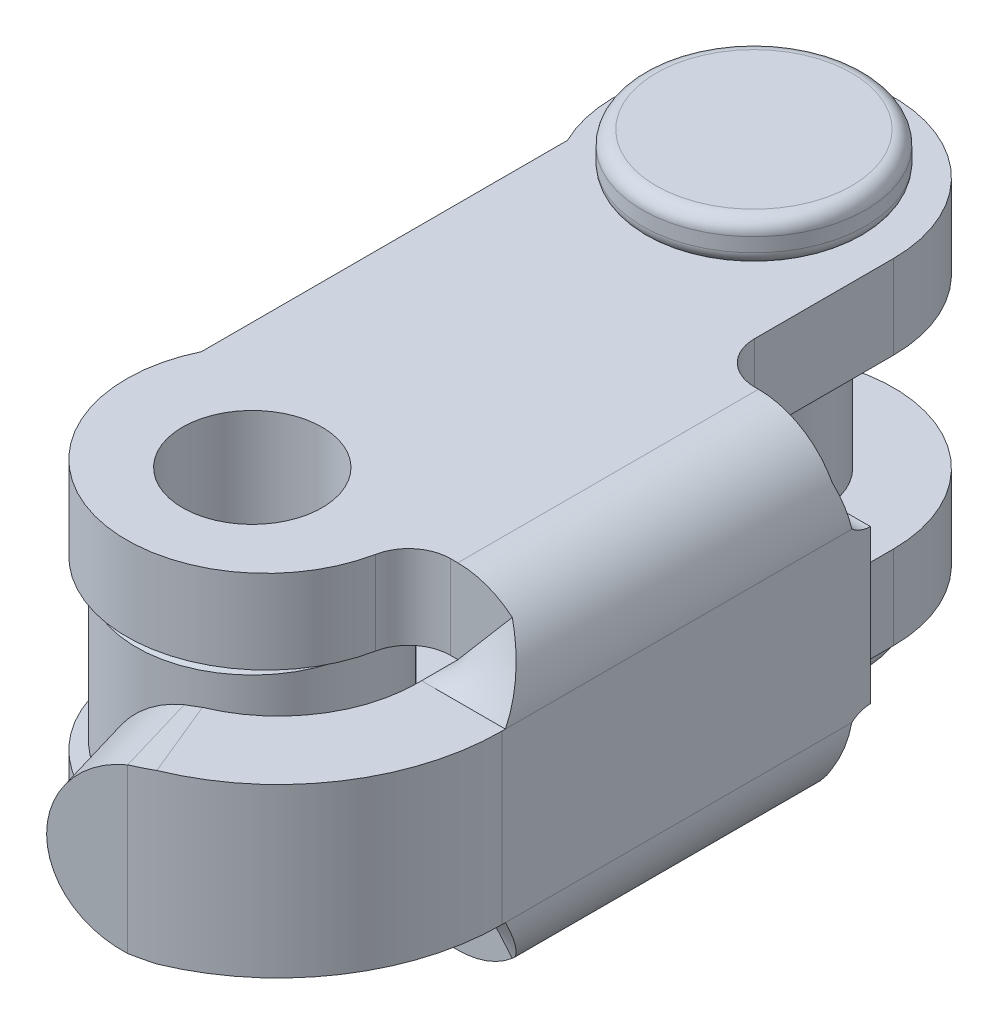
ISO-10303-21;
HEADER;
FILE_DESCRIPTION(('STEP AP214'),'2;1');
FILE_NAME('part.step','',(''),(''),'','','');
FILE_SCHEMA(('AUTOMOTIVE_DESIGN { 1 0 10303 214 1 1 1 1 }'));
ENDSEC;
DATA;
#1=APPLICATION_CONTEXT('core data for automotive mechanical design processes');
#2=APPLICATION_PROTOCOL_DEFINITION('international standard','automotive_design',2000,#1);
#3=PRODUCT_CONTEXT('',#1,'mechanical');
#4=PRODUCT('Part','Part','',(#3));
#5=PRODUCT_RELATED_PRODUCT_CATEGORY('part','',(#4));
#6=PRODUCT_DEFINITION_FORMATION('','',#4);
#7=PRODUCT_DEFINITION_CONTEXT('part definition',#1,'design');
#8=PRODUCT_DEFINITION('design','',#6,#7);
#9=PRODUCT_DEFINITION_SHAPE('','',#8);
#10=(LENGTH_UNIT() NAMED_UNIT(*) SI_UNIT(.MILLI.,.METRE.));
#11=(NAMED_UNIT(*) PLANE_ANGLE_UNIT() SI_UNIT($,.RADIAN.));
#12=(NAMED_UNIT(*) SI_UNIT($,.STERADIAN.) SOLID_ANGLE_UNIT());
#13=UNCERTAINTY_MEASURE_WITH_UNIT(LENGTH_MEASURE(1.E-05),#10,'distance_accuracy_value','');
#14=(GEOMETRIC_REPRESENTATION_CONTEXT(3) GLOBAL_UNCERTAINTY_ASSIGNED_CONTEXT((#13)) GLOBAL_UNIT_ASSIGNED_CONTEXT((#10,
#11,#12)) REPRESENTATION_CONTEXT('',''));
#15=CARTESIAN_POINT('',(0.,0.,0.));
#16=DIRECTION('',(0.,0.,1.));
#17=DIRECTION('',(1.,0.,0.));
#18=AXIS2_PLACEMENT_3D('',#15,#16,#17);
#19=CARTESIAN_POINT('',(0.,-7.504,0.));
#20=DIRECTION('',(0.,1.,0.));
#21=DIRECTION('',(-0.107767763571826,0.,-0.994176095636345));
#22=AXIS2_PLACEMENT_3D('',#19,#20,#21);
#23=PLANE('',#22);
#24=CARTESIAN_POINT('',(0.,-7.504,0.));
#25=DIRECTION('',(0.,-1.,0.));
#26=DIRECTION('',(-0.107767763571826,0.,-0.994176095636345));
#27=AXIS2_PLACEMENT_3D('',#24,#25,#26);
#28=CIRCLE('',#27,3.5);
#29=CARTESIAN_POINT('',(-0.377187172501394,-7.504,-3.47961633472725));
#30=VERTEX_POINT('',#29);
#31=EDGE_CURVE('E1172',#30,#30,#28,.T.);
#32=ORIENTED_EDGE('',*,*,#31,.T.);
#33=EDGE_LOOP('',(#32));
#34=FACE_BOUND('',#33,.T.);
#35=ADVANCED_FACE('F14',(#34),#23,.F.);
#36=CARTESIAN_POINT('',(0.,-7.004,0.));
#37=DIRECTION('',(0.,1.,0.));
#38=DIRECTION('',(-0.107767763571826,0.,-0.994176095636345));
#39=AXIS2_PLACEMENT_3D('',#36,#37,#38);
#40=TOROIDAL_SURFACE('',#39,3.5,0.5);
#41=CARTESIAN_POINT('',(0.,-7.004,0.));
#42=DIRECTION('',(0.,1.,0.));
#43=DIRECTION('',(-0.107767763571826,0.,-0.994176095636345));
#44=AXIS2_PLACEMENT_3D('',#41,#42,#43);
#45=CIRCLE('',#44,4.);
#46=CARTESIAN_POINT('',(-0.431071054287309,-7.004,-3.97670438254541));
#47=VERTEX_POINT('',#46);
#48=EDGE_CURVE('E1167',#47,#47,#45,.T.);
#49=ORIENTED_EDGE('',*,*,#48,.F.);
#50=EDGE_LOOP('',(#49));
#51=FACE_BOUND('',#50,.T.);
#52=ORIENTED_EDGE('',*,*,#31,.F.);
#53=EDGE_LOOP('',(#52));
#54=FACE_BOUND('',#53,.T.);
#55=ADVANCED_FACE('F1221',(#51,#54),#40,.T.);
#56=CARTESIAN_POINT('',(0.,-6.004,0.));
#57=DIRECTION('',(0.,-1.,0.));
#58=DIRECTION('',(0.107767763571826,0.,0.994176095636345));
#59=AXIS2_PLACEMENT_3D('',#56,#57,#58);
#60=CYLINDRICAL_SURFACE('',#59,4.);
#61=ORIENTED_EDGE('',*,*,#48,.T.);
#62=EDGE_LOOP('',(#61));
#63=FACE_BOUND('',#62,.T.);
#64=CARTESIAN_POINT('',(0.,-6.504,0.));
#65=DIRECTION('',(0.,-1.,0.));
#66=DIRECTION('',(-0.107767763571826,0.,-0.994176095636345));
#67=AXIS2_PLACEMENT_3D('',#64,#65,#66);
#68=CIRCLE('',#67,4.);
#69=CARTESIAN_POINT('',(-0.431071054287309,-6.504,-3.97670438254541));
#70=VERTEX_POINT('',#69);
#71=EDGE_CURVE('E1162',#70,#70,#68,.T.);
#72=ORIENTED_EDGE('',*,*,#71,.T.);
#73=EDGE_LOOP('',(#72));
#74=FACE_BOUND('',#73,.T.);
#75=ADVANCED_FACE('F1217',(#63,#74),#60,.T.);
#76=CARTESIAN_POINT('',(0.,-6.504,0.));
#77=DIRECTION('',(0.,1.,0.));
#78=DIRECTION('',(-0.107767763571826,0.,-0.994176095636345));
#79=AXIS2_PLACEMENT_3D('',#76,#77,#78);
#80=TOROIDAL_SURFACE('',#79,3.5,0.5);
#81=CARTESIAN_POINT('',(0.,-6.004,0.));
#82=DIRECTION('',(0.,1.,0.));
#83=DIRECTION('',(-0.107767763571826,0.,-0.994176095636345));
#84=AXIS2_PLACEMENT_3D('',#81,#82,#83);
#85=CIRCLE('',#84,3.5);
#86=CARTESIAN_POINT('',(-0.377187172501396,-6.004,-3.47961633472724));
#87=VERTEX_POINT('',#86);
#88=EDGE_CURVE('E1168',#87,#87,#85,.T.);
#89=ORIENTED_EDGE('',*,*,#88,.F.);
#90=EDGE_LOOP('',(#89));
#91=FACE_BOUND('',#90,.T.);
#92=ORIENTED_EDGE('',*,*,#71,.F.);
#93=EDGE_LOOP('',(#92));
#94=FACE_BOUND('',#93,.T.);
#95=ADVANCED_FACE('F1047',(#91,#94),#80,.T.);
#96=CARTESIAN_POINT('',(0.,7.504,0.));
#97=DIRECTION('',(0.,-1.,0.));
#98=DIRECTION('',(0.994176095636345,0.,-0.107767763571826));
#99=AXIS2_PLACEMENT_3D('',#96,#97,#98);
#100=PLANE('',#99);
#101=CARTESIAN_POINT('',(0.,7.504,0.));
#102=DIRECTION('',(0.,1.,0.));
#103=DIRECTION('',(0.107767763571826,0.,0.994176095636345));
#104=AXIS2_PLACEMENT_3D('',#101,#102,#103);
#105=CIRCLE('',#104,3.5);
#106=CARTESIAN_POINT('',(0.377187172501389,7.504,3.47961633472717));
#107=VERTEX_POINT('',#106);
#108=EDGE_CURVE('E1156',#107,#107,#105,.T.);
#109=ORIENTED_EDGE('',*,*,#108,.T.);
#110=EDGE_LOOP('',(#109));
#111=FACE_BOUND('',#110,.T.);
#112=ADVANCED_FACE('F537',(#111),#100,.F.);
#113=CARTESIAN_POINT('',(0.,7.004,0.));
#114=DIRECTION('',(0.,-1.,0.));
#115=DIRECTION('',(0.107767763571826,0.,0.994176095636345));
#116=AXIS2_PLACEMENT_3D('',#113,#114,#115);
#117=TOROIDAL_SURFACE('',#116,3.5,0.5);
#118=CARTESIAN_POINT('',(0.,7.004,0.));
#119=DIRECTION('',(0.,-1.,0.));
#120=DIRECTION('',(0.107767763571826,0.,0.994176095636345));
#121=AXIS2_PLACEMENT_3D('',#118,#119,#120);
#122=CIRCLE('',#121,4.);
#123=CARTESIAN_POINT('',(0.431071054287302,7.004,3.97670438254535));
#124=VERTEX_POINT('',#123);
#125=EDGE_CURVE('E1166',#124,#124,#122,.T.);
#126=ORIENTED_EDGE('',*,*,#125,.F.);
#127=EDGE_LOOP('',(#126));
#128=FACE_BOUND('',#127,.T.);
#129=ORIENTED_EDGE('',*,*,#108,.F.);
#130=EDGE_LOOP('',(#129));
#131=FACE_BOUND('',#130,.T.);
#132=ADVANCED_FACE('F1202',(#128,#131),#117,.T.);
#133=CARTESIAN_POINT('',(0.,6.004,0.));
#134=DIRECTION('',(0.,1.,0.));
#135=DIRECTION('',(-0.107767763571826,0.,-0.994176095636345));
#136=AXIS2_PLACEMENT_3D('',#133,#134,#135);
#137=CYLINDRICAL_SURFACE('',#136,4.);
#138=ORIENTED_EDGE('',*,*,#125,.T.);
#139=EDGE_LOOP('',(#138));
#140=FACE_BOUND('',#139,.T.);
#141=CARTESIAN_POINT('',(0.,6.504,0.));
#142=DIRECTION('',(0.,1.,0.));
#143=DIRECTION('',(0.107767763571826,0.,0.994176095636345));
#144=AXIS2_PLACEMENT_3D('',#141,#142,#143);
#145=CIRCLE('',#144,4.);
#146=CARTESIAN_POINT('',(0.431071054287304,6.504,3.97670438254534));
#147=VERTEX_POINT('',#146);
#148=EDGE_CURVE('E1161',#147,#147,#145,.T.);
#149=ORIENTED_EDGE('',*,*,#148,.T.);
#150=EDGE_LOOP('',(#149));
#151=FACE_BOUND('',#150,.T.);
#152=ADVANCED_FACE('F1197',(#140,#151),#137,.T.);
#153=CARTESIAN_POINT('',(0.,6.504,0.));
#154=DIRECTION('',(0.,-1.,0.));
#155=DIRECTION('',(0.107767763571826,0.,0.994176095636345));
#156=AXIS2_PLACEMENT_3D('',#153,#154,#155);
#157=TOROIDAL_SURFACE('',#156,3.5,0.5);
#158=CARTESIAN_POINT('',(0.,6.004,0.));
#159=DIRECTION('',(0.,-1.,0.));
#160=DIRECTION('',(0.107767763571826,0.,0.994176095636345));
#161=AXIS2_PLACEMENT_3D('',#158,#159,#160);
#162=CIRCLE('',#161,3.5);
#163=CARTESIAN_POINT('',(0.377187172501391,6.004,3.47961633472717));
#164=VERTEX_POINT('',#163);
#165=EDGE_CURVE('E1179',#164,#164,#162,.T.);
#166=ORIENTED_EDGE('',*,*,#165,.F.);
#167=EDGE_LOOP('',(#166));
#168=FACE_BOUND('',#167,.T.);
#169=ORIENTED_EDGE('',*,*,#148,.F.);
#170=EDGE_LOOP('',(#169));
#171=FACE_BOUND('',#170,.T.);
#172=ADVANCED_FACE('F1044',(#168,#171),#157,.T.);
#173=CARTESIAN_POINT('',(0.,6.004,0.));
#174=DIRECTION('',(0.,-1.,0.));
#175=DIRECTION('',(0.107767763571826,0.,0.994176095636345));
#176=AXIS2_PLACEMENT_3D('',#173,#174,#175);
#177=CYLINDRICAL_SURFACE('',#176,2.5);
#178=CARTESIAN_POINT('',(0.,3.004,0.));
#179=DIRECTION('',(0.,-1.,0.));
#180=DIRECTION('',(0.,0.,1.));
#181=AXIS2_PLACEMENT_3D('',#178,#179,#180);
#182=CIRCLE('',#181,2.5);
#183=CARTESIAN_POINT('',(0.,3.004,2.49999999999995));
#184=VERTEX_POINT('',#183);
#185=EDGE_CURVE('E27',#184,#184,#182,.F.);
#186=ORIENTED_EDGE('',*,*,#185,.F.);
#187=EDGE_LOOP('',(#186));
#188=FACE_BOUND('',#187,.T.);
#189=CARTESIAN_POINT('',(0.,-3.00399999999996,0.));
#190=DIRECTION('',(0.,1.,0.));
#191=DIRECTION('',(-1.,0.,0.));
#192=AXIS2_PLACEMENT_3D('',#189,#190,#191);
#193=CIRCLE('',#192,2.5);
#194=CARTESIAN_POINT('',(-2.50000000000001,-3.00399999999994,0.));
#195=VERTEX_POINT('',#194);
#196=EDGE_CURVE('E9',#195,#195,#193,.F.);
#197=ORIENTED_EDGE('',*,*,#196,.F.);
#198=EDGE_LOOP('',(#197));
#199=FACE_BOUND('',#198,.T.);
#200=ADVANCED_FACE('F1037',(#188,#199),#177,.T.);
#201=CARTESIAN_POINT('',(3.6986718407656,0.,23.2724067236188));
#202=DIRECTION('',(0.284015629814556,0.,0.95881965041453));
#203=DIRECTION('',(0.,1.,0.));
#204=AXIS2_PLACEMENT_3D('',#201,#202,#203);
#205=CYLINDRICAL_SURFACE('',#204,3.00000000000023);
#206=CARTESIAN_POINT('',(3.6986718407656,0.,23.2724067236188));
#207=DIRECTION('',(-0.284015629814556,0.,-0.95881965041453));
#208=DIRECTION('',(0.,-1.,0.));
#209=AXIS2_PLACEMENT_3D('',#206,#207,#208);
#210=CIRCLE('',#209,3.00000000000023);
#211=CARTESIAN_POINT('',(3.06160602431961,-2.92549765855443,23.4611144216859));
#212=VERTEX_POINT('',#211);
#213=CARTESIAN_POINT('',(3.06160602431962,2.92549765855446,23.4611144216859));
#214=VERTEX_POINT('',#213);
#215=EDGE_CURVE('E369',#212,#214,#210,.T.);
#216=ORIENTED_EDGE('',*,*,#215,.F.);
#217=CARTESIAN_POINT('',(3.06160602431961,-2.92549765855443,23.4611144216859));
#218=CARTESIAN_POINT('',(3.34562165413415,-2.92549765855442,24.4199340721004));
#219=CARTESIAN_POINT('',(3.62963728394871,-2.92549765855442,25.3787537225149));
#220=CARTESIAN_POINT('',(3.91365291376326,-2.92549765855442,26.3375733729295));
#221=(BOUNDED_CURVE() B_SPLINE_CURVE(3,(#217,#218,#219,#220),.UNSPECIFIED.,.F.,
.F.) B_SPLINE_CURVE_WITH_KNOTS((4,4),(0.,1.),
.UNSPECIFIED.) CURVE() GEOMETRIC_REPRESENTATION_ITEM() RATIONAL_B_SPLINE_CURVE((1.,1.,1.,1.)) REPRESENTATION_ITEM(''));
#222=CARTESIAN_POINT('',(3.91365291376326,-2.92549765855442,26.3375733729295));
#223=VERTEX_POINT('',#222);
#224=EDGE_CURVE('E278',#212,#223,#221,.T.);
#225=ORIENTED_EDGE('',*,*,#224,.T.);
#226=CARTESIAN_POINT('',(4.55071873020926,0.,26.1488656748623));
#227=DIRECTION('',(-0.284015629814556,0.,-0.95881965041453));
#228=DIRECTION('',(0.,-1.,0.));
#229=AXIS2_PLACEMENT_3D('',#226,#227,#228);
#230=CIRCLE('',#229,3.00000000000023);
#231=CARTESIAN_POINT('',(3.91365291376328,2.92549765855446,26.3375733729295));
#232=VERTEX_POINT('',#231);
#233=EDGE_CURVE('E339',#223,#232,#230,.T.);
#234=ORIENTED_EDGE('',*,*,#233,.T.);
#235=CARTESIAN_POINT('',(3.91365291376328,2.92549765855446,26.3375733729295));
#236=CARTESIAN_POINT('',(3.62963728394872,2.92549765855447,25.3787537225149));
#237=CARTESIAN_POINT('',(3.34562165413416,2.92549765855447,24.4199340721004));
#238=CARTESIAN_POINT('',(3.06160602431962,2.92549765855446,23.4611144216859));
#239=(BOUNDED_CURVE() B_SPLINE_CURVE(3,(#235,#236,#237,#238),.UNSPECIFIED.,.F.,
.F.) B_SPLINE_CURVE_WITH_KNOTS((4,4),(0.,1.),
.UNSPECIFIED.) CURVE() GEOMETRIC_REPRESENTATION_ITEM() RATIONAL_B_SPLINE_CURVE((1.,1.,1.,1.)) REPRESENTATION_ITEM(''));
#240=EDGE_CURVE('E334',#232,#214,#239,.T.);
#241=ORIENTED_EDGE('',*,*,#240,.T.);
#242=EDGE_LOOP('',(#216,#225,#234,#241));
#243=FACE_BOUND('',#242,.T.);
#244=ADVANCED_FACE('F1016',(#243),#205,.T.);
#245=CARTESIAN_POINT('',(10.985701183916,-5.62695571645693,21.1138879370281));
#246=DIRECTION('',(-0.284015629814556,0.,-0.95881965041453));
#247=DIRECTION('',(0.,1.,0.));
#248=AXIS2_PLACEMENT_3D('',#245,#246,#247);
#249=PLANE('',#248);
#250=DIRECTION('',(0.,1.,0.));
#251=VECTOR('',#250,1.);
#252=CARTESIAN_POINT('',(3.06160602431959,-5.6269557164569,23.4611144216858));
#253=LINE('',#252,#251);
#254=EDGE_CURVE('E670',#212,#214,#253,.T.);
#255=ORIENTED_EDGE('',*,*,#254,.F.);
#256=ORIENTED_EDGE('',*,*,#215,.T.);
#257=EDGE_LOOP('',(#255,#256));
#258=FACE_BOUND('',#257,.T.);
#259=ADVANCED_FACE('F1013',(#258),#249,.T.);
#260=CARTESIAN_POINT('',(1.64152787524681,-3.0000000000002,18.6670161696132));
#261=DIRECTION('',(0.,1.,0.));
#262=DIRECTION('',(-0.999999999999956,0.,2.97355841E-07));
#263=AXIS2_PLACEMENT_3D('',#260,#261,#262);
#264=PLANE('',#263);
#265=CARTESIAN_POINT('',(1.64152787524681,-3.0000000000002,18.6670161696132));
#266=DIRECTION('',(0.,-1.,0.));
#267=DIRECTION('',(-0.999999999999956,0.,2.97355840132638E-07));
#268=AXIS2_PLACEMENT_3D('',#265,#266,#267);
#269=CIRCLE('',#268,8.);
#270=CARTESIAN_POINT('',(9.64152787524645,-3.00000000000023,18.6670137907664));
#271=VERTEX_POINT('',#270);
#272=CARTESIAN_POINT('',(4.68450897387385,-3.00000000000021,26.0656826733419));
#273=VERTEX_POINT('',#272);
#274=EDGE_CURVE('E604',#271,#273,#269,.T.);
#275=ORIENTED_EDGE('',*,*,#274,.T.);
#276=CARTESIAN_POINT('',(4.68450897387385,-3.00000000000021,26.0656826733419));
#277=CARTESIAN_POINT('',(4.30413633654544,-3.0000000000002,25.1408493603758));
#278=CARTESIAN_POINT('',(3.92376369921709,-3.0000000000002,24.2160160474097));
#279=CARTESIAN_POINT('',(3.54339106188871,-3.00000000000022,23.2911827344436));
#280=(BOUNDED_CURVE() B_SPLINE_CURVE(3,(#276,#277,#278,#279),.UNSPECIFIED.,.F.,
.F.) B_SPLINE_CURVE_WITH_KNOTS((4,4),(0.,1.),
.UNSPECIFIED.) CURVE() GEOMETRIC_REPRESENTATION_ITEM() RATIONAL_B_SPLINE_CURVE((1.,1.,1.,1.)) REPRESENTATION_ITEM(''));
#281=CARTESIAN_POINT('',(3.54339106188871,-3.00000000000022,23.2911827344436));
#282=VERTEX_POINT('',#281);
#283=EDGE_CURVE('E599',#273,#282,#280,.T.);
#284=ORIENTED_EDGE('',*,*,#283,.T.);
#285=CARTESIAN_POINT('',(1.64152787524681,-3.0000000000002,18.6670161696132));
#286=DIRECTION('',(0.,-1.,0.));
#287=DIRECTION('',(0.999999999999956,0.,-2.97355841E-07));
#288=AXIS2_PLACEMENT_3D('',#285,#286,#287);
#289=CIRCLE('',#288,5.);
#290=CARTESIAN_POINT('',(6.64152787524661,-3.00000000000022,18.6670146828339));
#291=VERTEX_POINT('',#290);
#292=EDGE_CURVE('E605',#291,#282,#289,.T.);
#293=ORIENTED_EDGE('',*,*,#292,.F.);
#294=DIRECTION('',(2.97355841E-07,0.,0.999999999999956));
#295=VECTOR('',#294,1.);
#296=CARTESIAN_POINT('',(6.64152783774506,-3.00000000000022,18.5408980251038));
#297=LINE('',#296,#295);
#298=CARTESIAN_POINT('',(6.64152783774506,-3.00000000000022,18.5408980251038));
#299=VERTEX_POINT('',#298);
#300=EDGE_CURVE('E617',#299,#291,#297,.T.);
#301=ORIENTED_EDGE('',*,*,#300,.F.);
#302=CARTESIAN_POINT('',(6.64152783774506,-3.00000000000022,18.5408980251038));
#303=CARTESIAN_POINT('',(7.641527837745,-3.00000000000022,18.5408977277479));
#304=CARTESIAN_POINT('',(8.641527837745,-3.00000000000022,18.540897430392));
#305=CARTESIAN_POINT('',(9.64152783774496,-3.00000000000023,18.5408971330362));
#306=(BOUNDED_CURVE() B_SPLINE_CURVE(3,(#302,#303,#304,#305),.UNSPECIFIED.,.F.,
.F.) B_SPLINE_CURVE_WITH_KNOTS((4,4),(0.,1.),
.UNSPECIFIED.) CURVE() GEOMETRIC_REPRESENTATION_ITEM() RATIONAL_B_SPLINE_CURVE((1.,1.,1.,1.)) REPRESENTATION_ITEM(''));
#307=CARTESIAN_POINT('',(9.64152783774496,-3.00000000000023,18.5408971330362));
#308=VERTEX_POINT('',#307);
#309=EDGE_CURVE('E889',#299,#308,#306,.T.);
#310=ORIENTED_EDGE('',*,*,#309,.T.);
#311=DIRECTION('',(2.97355841E-07,0.,0.999999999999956));
#312=VECTOR('',#311,1.);
#313=CARTESIAN_POINT('',(9.64152783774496,-3.00000000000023,18.5408971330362));
#314=LINE('',#313,#312);
#315=EDGE_CURVE('E464',#308,#271,#314,.T.);
#316=ORIENTED_EDGE('',*,*,#315,.T.);
#317=EDGE_LOOP('',(#275,#284,#293,#301,#310,#316));
#318=FACE_BOUND('',#317,.T.);
#319=ADVANCED_FACE('F1015',(#318),#264,.F.);
#320=CARTESIAN_POINT('',(4.68450897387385,-3.00000000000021,26.0656826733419));
#321=CARTESIAN_POINT('',(4.43241199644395,-2.9751658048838,26.169367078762));
#322=CARTESIAN_POINT('',(4.17501410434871,-2.95033185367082,26.2601545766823));
#323=CARTESIAN_POINT('',(3.91365291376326,-2.92549765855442,26.3375733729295));
#324=CARTESIAN_POINT('',(3.54339106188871,-3.00000000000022,23.2911827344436));
#325=CARTESIAN_POINT('',(3.38583045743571,-2.97516580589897,23.3559854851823));
#326=CARTESIAN_POINT('',(3.22495676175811,-2.95033185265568,23.4127276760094));
#327=CARTESIAN_POINT('',(3.06160602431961,-2.92549765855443,23.4611144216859));
#328=(BOUNDED_SURFACE() B_SPLINE_SURFACE(1,3,((#320,#321,#322,#323),(#324,#325,#326,#327)),
.UNSPECIFIED.,.F.,.F.,.F.) B_SPLINE_SURFACE_WITH_KNOTS((2,2),(4,4),(0.,1.),(0.,1.),
.UNSPECIFIED.) GEOMETRIC_REPRESENTATION_ITEM() RATIONAL_B_SPLINE_SURFACE(((1.,1.,1.,1.),(1.,1.,
1.,1.))) REPRESENTATION_ITEM('') SURFACE());
#329=CARTESIAN_POINT('',(4.68450897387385,-3.00000000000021,26.0656826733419));
#330=CARTESIAN_POINT('',(4.43241199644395,-2.9751658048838,26.169367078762));
#331=CARTESIAN_POINT('',(4.17501410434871,-2.95033185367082,26.2601545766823));
#332=CARTESIAN_POINT('',(3.91365291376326,-2.92549765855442,26.3375733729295));
#333=(BOUNDED_CURVE() B_SPLINE_CURVE(3,(#329,#330,#331,#332),.UNSPECIFIED.,.F.,
.F.) B_SPLINE_CURVE_WITH_KNOTS((4,4),(0.,1.),
.UNSPECIFIED.) CURVE() GEOMETRIC_REPRESENTATION_ITEM() RATIONAL_B_SPLINE_CURVE((1.,1.,1.,1.)) REPRESENTATION_ITEM(''));
#334=EDGE_CURVE('E355',#273,#223,#333,.T.);
#335=CARTESIAN_POINT('',(3.54339106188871,-3.00000000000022,23.2911827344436));
#336=CARTESIAN_POINT('',(3.38583096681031,-2.97516588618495,23.3559852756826));
#337=CARTESIAN_POINT('',(3.22495623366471,-2.9503317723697,23.4127278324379));
#338=CARTESIAN_POINT('',(3.06160602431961,-2.92549765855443,23.4611144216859));
#339=(BOUNDED_CURVE() B_SPLINE_CURVE(3,(#335,#336,#337,#338),.UNSPECIFIED.,.F.,
.F.) B_SPLINE_CURVE_WITH_KNOTS((4,4),(0.,1.),
.UNSPECIFIED.) CURVE() GEOMETRIC_REPRESENTATION_ITEM() RATIONAL_B_SPLINE_CURVE((1.,1.,1.,1.)) REPRESENTATION_ITEM(''));
#340=EDGE_CURVE('E271',#282,#212,#339,.T.);
#341=ORIENTED_EDGE('',*,*,#283,.F.);
#342=ORIENTED_EDGE('',*,*,#334,.T.);
#343=ORIENTED_EDGE('',*,*,#224,.F.);
#344=ORIENTED_EDGE('',*,*,#340,.F.);
#345=EDGE_LOOP('',(#341,#342,#343,#344));
#346=FACE_BOUND('',#345,.T.);
#347=ADVANCED_FACE('F2285',(#346),#328,.F.);
#348=CARTESIAN_POINT('',(11.8377480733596,-5.62695571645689,23.9903468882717));
#349=DIRECTION('',(-0.284015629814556,0.,-0.95881965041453));
#350=DIRECTION('',(0.,1.,0.));
#351=AXIS2_PLACEMENT_3D('',#348,#349,#350);
#352=PLANE('',#351);
#353=ORIENTED_EDGE('',*,*,#233,.F.);
#354=DIRECTION('',(0.,1.,0.));
#355=VECTOR('',#354,1.);
#356=CARTESIAN_POINT('',(3.91365291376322,-5.6269557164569,26.3375733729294));
#357=LINE('',#356,#355);
#358=EDGE_CURVE('E340',#223,#232,#357,.T.);
#359=ORIENTED_EDGE('',*,*,#358,.T.);
#360=EDGE_LOOP('',(#353,#359));
#361=FACE_BOUND('',#360,.T.);
#362=ADVANCED_FACE('F431',(#361),#352,.F.);
#363=CARTESIAN_POINT('',(3.91365291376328,2.92549765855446,26.3375733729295));
#364=CARTESIAN_POINT('',(4.1750141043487,2.95033185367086,26.2601545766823));
#365=CARTESIAN_POINT('',(4.43241199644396,2.97516580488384,26.1693670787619));
#366=CARTESIAN_POINT('',(4.68450897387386,3.00000000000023,26.0656826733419));
#367=CARTESIAN_POINT('',(3.06160602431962,2.92549765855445,23.4611144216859));
#368=CARTESIAN_POINT('',(3.22495676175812,2.9503318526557,23.4127276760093));
#369=CARTESIAN_POINT('',(3.38583045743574,2.97516580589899,23.3559854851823));
#370=CARTESIAN_POINT('',(3.54339106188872,3.00000000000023,23.2911827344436));
#371=(BOUNDED_SURFACE() B_SPLINE_SURFACE(1,3,((#363,#364,#365,#366),(#367,#368,#369,#370)),
.UNSPECIFIED.,.F.,.F.,.F.) B_SPLINE_SURFACE_WITH_KNOTS((2,2),(4,4),(0.,1.),(0.,1.),
.UNSPECIFIED.) GEOMETRIC_REPRESENTATION_ITEM() RATIONAL_B_SPLINE_SURFACE(((1.,1.,1.,1.),(1.,1.,
1.,1.))) REPRESENTATION_ITEM('') SURFACE());
#372=CARTESIAN_POINT('',(3.91365291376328,2.92549765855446,26.3375733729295));
#373=CARTESIAN_POINT('',(4.1750141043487,2.95033185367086,26.2601545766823));
#374=CARTESIAN_POINT('',(4.43241199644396,2.97516580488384,26.1693670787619));
#375=CARTESIAN_POINT('',(4.68450897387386,3.00000000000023,26.0656826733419));
#376=(BOUNDED_CURVE() B_SPLINE_CURVE(3,(#372,#373,#374,#375),.UNSPECIFIED.,.F.,
.F.) B_SPLINE_CURVE_WITH_KNOTS((4,4),(0.,1.),
.UNSPECIFIED.) CURVE() GEOMETRIC_REPRESENTATION_ITEM() RATIONAL_B_SPLINE_CURVE((1.,1.,1.,1.)) REPRESENTATION_ITEM(''));
#377=CARTESIAN_POINT('',(4.68450897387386,3.00000000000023,26.0656826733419));
#378=VERTEX_POINT('',#377);
#379=EDGE_CURVE('E349',#232,#378,#376,.T.);
#380=CARTESIAN_POINT('',(4.68450897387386,3.00000000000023,26.0656826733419));
#381=CARTESIAN_POINT('',(3.54339106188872,3.00000000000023,23.2911827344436));
#382=(BOUNDED_CURVE() B_SPLINE_CURVE(1,(#380,#381),.UNSPECIFIED.,.F.,
.F.) B_SPLINE_CURVE_WITH_KNOTS((2,2),(0.,1.),
.UNSPECIFIED.) CURVE() GEOMETRIC_REPRESENTATION_ITEM() RATIONAL_B_SPLINE_CURVE((1.,1.)) REPRESENTATION_ITEM(''));
#383=CARTESIAN_POINT('',(3.54339106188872,3.00000000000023,23.2911827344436));
#384=VERTEX_POINT('',#383);
#385=EDGE_CURVE('E356',#378,#384,#382,.T.);
#386=CARTESIAN_POINT('',(3.06160602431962,2.92549765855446,23.4611144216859));
#387=CARTESIAN_POINT('',(3.22495623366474,2.95033177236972,23.4127278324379));
#388=CARTESIAN_POINT('',(3.3858309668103,2.97516588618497,23.3559852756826));
#389=CARTESIAN_POINT('',(3.54339106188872,3.00000000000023,23.2911827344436));
#390=(BOUNDED_CURVE() B_SPLINE_CURVE(3,(#386,#387,#388,#389),.UNSPECIFIED.,.F.,
.F.) B_SPLINE_CURVE_WITH_KNOTS((4,4),(0.,1.),
.UNSPECIFIED.) CURVE() GEOMETRIC_REPRESENTATION_ITEM() RATIONAL_B_SPLINE_CURVE((1.,1.,1.,1.)) REPRESENTATION_ITEM(''));
#391=EDGE_CURVE('E616',#214,#384,#390,.T.);
#392=ORIENTED_EDGE('',*,*,#240,.F.);
#393=ORIENTED_EDGE('',*,*,#379,.T.);
#394=ORIENTED_EDGE('',*,*,#385,.T.);
#395=ORIENTED_EDGE('',*,*,#391,.F.);
#396=EDGE_LOOP('',(#392,#393,#394,#395));
#397=FACE_BOUND('',#396,.T.);
#398=ADVANCED_FACE('F416',(#397),#371,.F.);
#399=CARTESIAN_POINT('',(1.64152787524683,3.00000000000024,18.6670161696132));
#400=DIRECTION('',(0.,-1.,0.));
#401=DIRECTION('',(2.97355841E-07,0.,0.999999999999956));
#402=AXIS2_PLACEMENT_3D('',#399,#400,#401);
#403=PLANE('',#402);
#404=ORIENTED_EDGE('',*,*,#385,.F.);
#405=CARTESIAN_POINT('',(1.64152787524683,3.00000000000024,18.6670161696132));
#406=DIRECTION('',(0.,1.,0.));
#407=DIRECTION('',(-0.999999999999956,0.,2.97355841E-07));
#408=AXIS2_PLACEMENT_3D('',#405,#406,#407);
#409=CIRCLE('',#408,8.);
#410=CARTESIAN_POINT('',(9.6415278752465,3.00000000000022,18.6670137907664));
#411=VERTEX_POINT('',#410);
#412=EDGE_CURVE('E665',#378,#411,#409,.T.);
#413=ORIENTED_EDGE('',*,*,#412,.T.);
#414=DIRECTION('',(-2.97355841E-07,0.,-0.999999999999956));
#415=VECTOR('',#414,1.);
#416=CARTESIAN_POINT('',(9.64152783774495,3.00000000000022,18.5408971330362));
#417=LINE('',#416,#415);
#418=CARTESIAN_POINT('',(9.64152783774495,3.00000000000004,18.5408971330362));
#419=VERTEX_POINT('',#418);
#420=EDGE_CURVE('E457',#411,#419,#417,.T.);
#421=ORIENTED_EDGE('',*,*,#420,.T.);
#422=CARTESIAN_POINT('',(6.6415278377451,3.,18.5408980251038));
#423=CARTESIAN_POINT('',(9.64152783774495,3.00000000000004,18.5408971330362));
#424=(BOUNDED_CURVE() B_SPLINE_CURVE(1,(#422,#423),.UNSPECIFIED.,.F.,
.F.) B_SPLINE_CURVE_WITH_KNOTS((2,2),(0.,1.),
.UNSPECIFIED.) CURVE() GEOMETRIC_REPRESENTATION_ITEM() RATIONAL_B_SPLINE_CURVE((1.,1.)) REPRESENTATION_ITEM(''));
#425=CARTESIAN_POINT('',(6.6415278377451,3.,18.5408980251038));
#426=VERTEX_POINT('',#425);
#427=EDGE_CURVE('E444',#426,#419,#424,.T.);
#428=ORIENTED_EDGE('',*,*,#427,.F.);
#429=DIRECTION('',(-2.97355841E-07,0.,-0.999999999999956));
#430=VECTOR('',#429,1.);
#431=CARTESIAN_POINT('',(6.6415278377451,3.00000000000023,18.5408980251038));
#432=LINE('',#431,#430);
#433=CARTESIAN_POINT('',(6.6415278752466,3.00000000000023,18.6670146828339));
#434=VERTEX_POINT('',#433);
#435=EDGE_CURVE('E634',#434,#426,#432,.T.);
#436=ORIENTED_EDGE('',*,*,#435,.F.);
#437=CARTESIAN_POINT('',(1.64152787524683,3.00000000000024,18.6670161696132));
#438=DIRECTION('',(0.,1.,0.));
#439=DIRECTION('',(-0.999999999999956,0.,2.97355841E-07));
#440=AXIS2_PLACEMENT_3D('',#437,#438,#439);
#441=CIRCLE('',#440,5.);
#442=EDGE_CURVE('E612',#384,#434,#441,.T.);
#443=ORIENTED_EDGE('',*,*,#442,.F.);
#444=EDGE_LOOP('',(#404,#413,#421,#428,#436,#443));
#445=FACE_BOUND('',#444,.T.);
#446=ADVANCED_FACE('F528',(#445),#403,.F.);
#447=CARTESIAN_POINT('',(1.64152787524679,-10.7017485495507,18.6670161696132));
#448=DIRECTION('',(0.,1.,0.));
#449=DIRECTION('',(-0.999999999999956,0.,2.97355841E-07));
#450=AXIS2_PLACEMENT_3D('',#447,#448,#449);
#451=CYLINDRICAL_SURFACE('',#450,5.);
#452=DIRECTION('',(0.,1.,0.));
#453=VECTOR('',#452,1.);
#454=CARTESIAN_POINT('',(6.64152787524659,-5.62695571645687,18.6670146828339));
#455=LINE('',#454,#453);
#456=EDGE_CURVE('E622',#291,#434,#455,.T.);
#457=ORIENTED_EDGE('',*,*,#456,.F.);
#458=ORIENTED_EDGE('',*,*,#292,.T.);
#459=ORIENTED_EDGE('',*,*,#340,.T.);
#460=ORIENTED_EDGE('',*,*,#254,.T.);
#461=ORIENTED_EDGE('',*,*,#391,.T.);
#462=ORIENTED_EDGE('',*,*,#442,.T.);
#463=EDGE_LOOP('',(#457,#458,#459,#460,#461,#462));
#464=FACE_BOUND('',#463,.T.);
#465=ADVANCED_FACE('F524',(#464),#451,.F.);
#466=CARTESIAN_POINT('',(5.34124105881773E-06,3.,17.9625000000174));
#467=DIRECTION('',(0.,-1.,0.));
#468=DIRECTION('',(0.320525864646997,0.,0.947239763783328));
#469=AXIS2_PLACEMENT_3D('',#466,#467,#468);
#470=CYLINDRICAL_SURFACE('',#469,4.15);
#471=CARTESIAN_POINT('',(5.34124106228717E-06,-2.5,17.9625000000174));
#472=DIRECTION('',(0.,1.,0.));
#473=DIRECTION('',(-0.320525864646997,0.,-0.947239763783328));
#474=AXIS2_PLACEMENT_3D('',#471,#472,#473);
#475=CIRCLE('',#474,4.15);
#476=CARTESIAN_POINT('',(-1.33017699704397,-2.5,14.0314549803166));
#477=VERTEX_POINT('',#476);
#478=EDGE_CURVE('E1134',#477,#477,#475,.T.);
#479=ORIENTED_EDGE('',*,*,#478,.T.);
#480=EDGE_LOOP('',(#479));
#481=FACE_BOUND('',#480,.T.);
#482=CARTESIAN_POINT('',(5.34124105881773E-06,2.5,17.9625000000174));
#483=DIRECTION('',(0.,-1.,0.));
#484=DIRECTION('',(-0.320525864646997,0.,-0.947239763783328));
#485=AXIS2_PLACEMENT_3D('',#482,#483,#484);
#486=CIRCLE('',#485,4.15);
#487=CARTESIAN_POINT('',(-1.33017699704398,2.5,14.0314549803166));
#488=VERTEX_POINT('',#487);
#489=EDGE_CURVE('E1153',#488,#488,#486,.T.);
#490=ORIENTED_EDGE('',*,*,#489,.T.);
#491=EDGE_LOOP('',(#490));
#492=FACE_BOUND('',#491,.T.);
#493=ADVANCED_FACE('F527',(#481,#492),#470,.T.);
#494=CARTESIAN_POINT('',(1.64152787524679,-10.7017485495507,18.6670161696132));
#495=DIRECTION('',(0.,1.,0.));
#496=DIRECTION('',(-0.999999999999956,0.,2.97355841E-07));
#497=AXIS2_PLACEMENT_3D('',#494,#495,#496);
#498=CYLINDRICAL_SURFACE('',#497,8.);
#499=DIRECTION('',(0.,1.,0.));
#500=VECTOR('',#499,1.);
#501=CARTESIAN_POINT('',(9.64152787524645,-5.62695571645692,18.6670137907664));
#502=LINE('',#501,#500);
#503=EDGE_CURVE('E373',#271,#411,#502,.T.);
#504=ORIENTED_EDGE('',*,*,#503,.T.);
#505=ORIENTED_EDGE('',*,*,#412,.F.);
#506=ORIENTED_EDGE('',*,*,#379,.F.);
#507=ORIENTED_EDGE('',*,*,#358,.F.);
#508=ORIENTED_EDGE('',*,*,#334,.F.);
#509=ORIENTED_EDGE('',*,*,#274,.F.);
#510=EDGE_LOOP('',(#504,#505,#506,#507,#508,#509));
#511=FACE_BOUND('',#510,.T.);
#512=ADVANCED_FACE('F1033',(#511),#498,.T.);
#513=CARTESIAN_POINT('',(6.64152395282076,3.75,5.4759980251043));
#514=DIRECTION('',(0.999999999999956,0.,-2.97355841E-07));
#515=DIRECTION('',(0.,1.,0.));
#516=AXIS2_PLACEMENT_3D('',#513,#514,#515);
#517=CYLINDRICAL_SURFACE('',#516,1.);
#518=CARTESIAN_POINT('',(6.64152395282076,3.75,5.4759980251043));
#519=DIRECTION('',(0.999999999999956,0.,-2.97355841E-07));
#520=DIRECTION('',(0.,-1.,0.));
#521=AXIS2_PLACEMENT_3D('',#518,#519,#520);
#522=CIRCLE('',#521,1.);
#523=CARTESIAN_POINT('',(6.64152414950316,3.,6.1374358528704));
#524=VERTEX_POINT('',#523);
#525=CARTESIAN_POINT('',(6.64152395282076,2.75,5.4759980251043));
#526=VERTEX_POINT('',#525);
#527=EDGE_CURVE('E597',#524,#526,#522,.T.);
#528=ORIENTED_EDGE('',*,*,#527,.F.);
#529=CARTESIAN_POINT('',(6.64152414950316,3.,6.1374358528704));
#530=CARTESIAN_POINT('',(7.6415241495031,3.,6.13743555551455));
#531=CARTESIAN_POINT('',(8.6415241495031,3.,6.13743525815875));
#532=CARTESIAN_POINT('',(9.64152414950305,3.,6.1374349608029));
#533=(BOUNDED_CURVE() B_SPLINE_CURVE(3,(#529,#530,#531,#532),.UNSPECIFIED.,.F.,
.F.) B_SPLINE_CURVE_WITH_KNOTS((4,4),(0.,1.),
.UNSPECIFIED.) CURVE() GEOMETRIC_REPRESENTATION_ITEM() RATIONAL_B_SPLINE_CURVE((1.,1.,1.,1.)) REPRESENTATION_ITEM(''));
#534=CARTESIAN_POINT('',(9.64152414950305,3.,6.1374349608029));
#535=VERTEX_POINT('',#534);
#536=EDGE_CURVE('E1776',#524,#535,#533,.T.);
#537=ORIENTED_EDGE('',*,*,#536,.T.);
#538=CARTESIAN_POINT('',(9.64152395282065,3.75,5.47599713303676));
#539=DIRECTION('',(0.999999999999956,0.,-2.97355841E-07));
#540=DIRECTION('',(0.,-1.,0.));
#541=AXIS2_PLACEMENT_3D('',#538,#539,#540);
#542=CIRCLE('',#541,1.);
#543=CARTESIAN_POINT('',(9.64152395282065,2.75,5.47599713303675));
#544=VERTEX_POINT('',#543);
#545=EDGE_CURVE('E956',#535,#544,#542,.T.);
#546=ORIENTED_EDGE('',*,*,#545,.T.);
#547=DIRECTION('',(0.999999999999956,0.,-2.97355841E-07));
#548=VECTOR('',#547,1.);
#549=CARTESIAN_POINT('',(6.64152395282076,2.75,5.4759980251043));
#550=LINE('',#549,#548);
#551=EDGE_CURVE('E805',#526,#544,#550,.T.);
#552=ORIENTED_EDGE('',*,*,#551,.F.);
#553=EDGE_LOOP('',(#528,#537,#546,#552));
#554=FACE_BOUND('',#553,.T.);
#555=ADVANCED_FACE('F1026',(#554),#517,.F.);
#556=CARTESIAN_POINT('',(6.64152395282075,-2.75,5.47599802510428));
#557=DIRECTION('',(2.97355841E-07,0.,0.999999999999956));
#558=DIRECTION('',(0.,-1.,0.));
#559=AXIS2_PLACEMENT_3D('',#556,#557,#558);
#560=PLANE('',#559);
#561=DIRECTION('',(0.,-1.,0.));
#562=VECTOR('',#561,1.);
#563=CARTESIAN_POINT('',(9.64152395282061,-2.75,5.47599713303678));
#564=LINE('',#563,#562);
#565=CARTESIAN_POINT('',(9.64152395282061,-2.75,5.47599713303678));
#566=VERTEX_POINT('',#565);
#567=EDGE_CURVE('E465',#544,#566,#564,.T.);
#568=ORIENTED_EDGE('',*,*,#567,.T.);
#569=DIRECTION('',(0.999999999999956,0.,-2.97355841E-07));
#570=VECTOR('',#569,1.);
#571=CARTESIAN_POINT('',(6.64152395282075,-2.75,5.47599802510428));
#572=LINE('',#571,#570);
#573=CARTESIAN_POINT('',(6.64152395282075,-2.75,5.47599802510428));
#574=VERTEX_POINT('',#573);
#575=EDGE_CURVE('E801',#574,#566,#572,.T.);
#576=ORIENTED_EDGE('',*,*,#575,.F.);
#577=DIRECTION('',(0.,-1.,0.));
#578=VECTOR('',#577,1.);
#579=CARTESIAN_POINT('',(6.64152395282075,-2.75,5.47599802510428));
#580=LINE('',#579,#578);
#581=EDGE_CURVE('E594',#526,#574,#580,.T.);
#582=ORIENTED_EDGE('',*,*,#581,.F.);
#583=ORIENTED_EDGE('',*,*,#551,.T.);
#584=EDGE_LOOP('',(#568,#576,#582,#583));
#585=FACE_BOUND('',#584,.T.);
#586=ADVANCED_FACE('F522',(#585),#560,.F.);
#587=CARTESIAN_POINT('',(6.64152395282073,-3.75,5.47599802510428));
#588=DIRECTION('',(0.999999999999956,0.,-2.97355841E-07));
#589=DIRECTION('',(0.,1.,0.));
#590=AXIS2_PLACEMENT_3D('',#587,#588,#589);
#591=CYLINDRICAL_SURFACE('',#590,1.);
#592=CARTESIAN_POINT('',(6.64152414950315,-3.00000000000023,6.13743585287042));
#593=CARTESIAN_POINT('',(9.641524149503,-3.00000000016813,6.13743496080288));
#594=(BOUNDED_CURVE() B_SPLINE_CURVE(1,(#592,#593),.UNSPECIFIED.,.F.,
.F.) B_SPLINE_CURVE_WITH_KNOTS((2,2),(0.,1.),
.UNSPECIFIED.) CURVE() GEOMETRIC_REPRESENTATION_ITEM() RATIONAL_B_SPLINE_CURVE((1.,1.)) REPRESENTATION_ITEM(''));
#595=CARTESIAN_POINT('',(6.64152414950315,-3.00000000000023,6.13743585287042));
#596=VERTEX_POINT('',#595);
#597=CARTESIAN_POINT('',(9.641524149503,-3.00000000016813,6.13743496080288));
#598=VERTEX_POINT('',#597);
#599=EDGE_CURVE('E772',#596,#598,#594,.T.);
#600=ORIENTED_EDGE('',*,*,#599,.F.);
#601=CARTESIAN_POINT('',(6.64152395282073,-3.75,5.47599802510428));
#602=DIRECTION('',(0.999999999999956,0.,-2.97355841E-07));
#603=DIRECTION('',(0.,-1.,0.));
#604=AXIS2_PLACEMENT_3D('',#601,#602,#603);
#605=CIRCLE('',#604,1.);
#606=EDGE_CURVE('E739',#574,#596,#605,.T.);
#607=ORIENTED_EDGE('',*,*,#606,.F.);
#608=ORIENTED_EDGE('',*,*,#575,.T.);
#609=CARTESIAN_POINT('',(9.64152395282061,-3.75,5.47599713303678));
#610=DIRECTION('',(0.999999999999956,0.,-2.97355841E-07));
#611=DIRECTION('',(0.,-1.,0.));
#612=AXIS2_PLACEMENT_3D('',#609,#610,#611);
#613=CIRCLE('',#612,1.);
#614=EDGE_CURVE('E806',#566,#598,#613,.T.);
#615=ORIENTED_EDGE('',*,*,#614,.T.);
#616=EDGE_LOOP('',(#600,#607,#608,#615));
#617=FACE_BOUND('',#616,.T.);
#618=ADVANCED_FACE('F518',(#617),#591,.F.);
#619=CARTESIAN_POINT('',(5.34124106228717E-06,-2.5,17.9625000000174));
#620=DIRECTION('',(0.,1.,0.));
#621=DIRECTION('',(-0.320525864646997,0.,-0.947239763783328));
#622=AXIS2_PLACEMENT_3D('',#619,#620,#621);
#623=CONICAL_SURFACE('',#622,4.15,0.785398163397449);
#624=ORIENTED_EDGE('',*,*,#478,.F.);
#625=EDGE_LOOP('',(#624));
#626=FACE_BOUND('',#625,.T.);
#627=CARTESIAN_POINT('',(5.3412410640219E-06,-3.,17.9625000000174));
#628=DIRECTION('',(0.,-1.,0.));
#629=DIRECTION('',(-0.320525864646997,0.,-0.947239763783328));
#630=AXIS2_PLACEMENT_3D('',#627,#628,#629);
#631=CIRCLE('',#630,3.65);
#632=CARTESIAN_POINT('',(-1.16991406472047,-3.,14.5050748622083));
#633=VERTEX_POINT('',#632);
#634=EDGE_CURVE('E560',#633,#633,#631,.T.);
#635=ORIENTED_EDGE('',*,*,#634,.F.);
#636=EDGE_LOOP('',(#635));
#637=FACE_BOUND('',#636,.T.);
#638=ADVANCED_FACE('F521',(#626,#637),#623,.T.);
#639=CARTESIAN_POINT('',(6.64152789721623,-5.62695571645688,18.7408980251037));
#640=DIRECTION('',(-0.999999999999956,0.,2.97355841E-07));
#641=DIRECTION('',(0.,-1.,0.));
#642=AXIS2_PLACEMENT_3D('',#639,#640,#641);
#643=PLANE('',#642);
#644=ORIENTED_EDGE('',*,*,#606,.T.);
#645=DIRECTION('',(2.97355841E-07,0.,0.999999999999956));
#646=VECTOR('',#645,1.);
#647=CARTESIAN_POINT('',(6.64152789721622,-3.,18.7408980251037));
#648=LINE('',#647,#646);
#649=EDGE_CURVE('E621',#596,#299,#648,.T.);
#650=ORIENTED_EDGE('',*,*,#649,.T.);
#651=ORIENTED_EDGE('',*,*,#300,.T.);
#652=ORIENTED_EDGE('',*,*,#456,.T.);
#653=ORIENTED_EDGE('',*,*,#435,.T.);
#654=DIRECTION('',(2.97355841E-07,0.,0.999999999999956));
#655=VECTOR('',#654,1.);
#656=CARTESIAN_POINT('',(6.64152789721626,3.,18.7408980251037));
#657=LINE('',#656,#655);
#658=EDGE_CURVE('E381',#524,#426,#657,.T.);
#659=ORIENTED_EDGE('',*,*,#658,.F.);
#660=ORIENTED_EDGE('',*,*,#527,.T.);
#661=ORIENTED_EDGE('',*,*,#581,.T.);
#662=EDGE_LOOP('',(#644,#650,#651,#652,#653,#659,#660,#661));
#663=FACE_BOUND('',#662,.T.);
#664=ADVANCED_FACE('F893',(#663),#643,.T.);
#665=CARTESIAN_POINT('',(5.34124105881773E-06,3.,17.9625000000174));
#666=DIRECTION('',(0.,-1.,0.));
#667=DIRECTION('',(0.320525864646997,0.,0.947239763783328));
#668=AXIS2_PLACEMENT_3D('',#665,#666,#667);
#669=CONICAL_SURFACE('',#668,3.65,0.785398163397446);
#670=ORIENTED_EDGE('',*,*,#489,.F.);
#671=EDGE_LOOP('',(#670));
#672=FACE_BOUND('',#671,.T.);
#673=CARTESIAN_POINT('',(5.34124105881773E-06,3.,17.9625000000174));
#674=DIRECTION('',(0.,1.,0.));
#675=DIRECTION('',(-0.320525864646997,0.,-0.947239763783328));
#676=AXIS2_PLACEMENT_3D('',#673,#674,#675);
#677=CIRCLE('',#676,3.65);
#678=CARTESIAN_POINT('',(-1.16991406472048,3.,14.5050748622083));
#679=VERTEX_POINT('',#678);
#680=EDGE_CURVE('E564',#679,#679,#677,.T.);
#681=ORIENTED_EDGE('',*,*,#680,.F.);
#682=EDGE_LOOP('',(#681));
#683=FACE_BOUND('',#682,.T.);
#684=ADVANCED_FACE('F980',(#672,#683),#669,.T.);
#685=CARTESIAN_POINT('',(9.641524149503,-3.00000000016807,6.13743496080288));
#686=CARTESIAN_POINT('',(9.64152418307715,-3.49999443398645,6.25043803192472));
#687=CARTESIAN_POINT('',(9.514821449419,-3.99758261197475,6.36299409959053));
#688=CARTESIAN_POINT('',(9.27569508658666,-4.43668738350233,6.47599724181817));
#689=CARTESIAN_POINT('',(6.64152414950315,-3.00000000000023,6.13743585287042));
#690=CARTESIAN_POINT('',(6.64152418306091,-3.00066489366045,6.25028991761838));
#691=CARTESIAN_POINT('',(6.64135508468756,-3.00132911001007,6.36314396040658));
#692=CARTESIAN_POINT('',(6.64103712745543,-3.00191303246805,6.47599802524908));
#693=(BOUNDED_SURFACE() B_SPLINE_SURFACE(1,3,((#685,#686,#687,#688),(#689,#690,#691,#692)),
.UNSPECIFIED.,.F.,.F.,.F.) B_SPLINE_SURFACE_WITH_KNOTS((2,2),(4,4),(0.,1.),(0.,1.),
.UNSPECIFIED.) GEOMETRIC_REPRESENTATION_ITEM() RATIONAL_B_SPLINE_SURFACE(((1.,1.,1.,1.),(1.,1.,
1.,1.))) REPRESENTATION_ITEM('') SURFACE());
#694=CARTESIAN_POINT('',(9.641524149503,-3.00000000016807,6.13743496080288));
#695=CARTESIAN_POINT('',(9.64152418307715,-3.49999443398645,6.25043803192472));
#696=CARTESIAN_POINT('',(9.514821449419,-3.99758261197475,6.36299409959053));
#697=CARTESIAN_POINT('',(9.27569508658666,-4.43668738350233,6.47599724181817));
#698=(BOUNDED_CURVE() B_SPLINE_CURVE(3,(#694,#695,#696,#697),.UNSPECIFIED.,.F.,
.F.) B_SPLINE_CURVE_WITH_KNOTS((4,4),(0.,1.),
.UNSPECIFIED.) CURVE() GEOMETRIC_REPRESENTATION_ITEM() RATIONAL_B_SPLINE_CURVE((1.,1.,1.,1.)) REPRESENTATION_ITEM(''));
#699=CARTESIAN_POINT('',(9.27569508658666,-4.43668738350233,6.47599724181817));
#700=VERTEX_POINT('',#699);
#701=EDGE_CURVE('E904',#598,#700,#698,.T.);
#702=CARTESIAN_POINT('',(9.27569508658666,-4.43668738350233,6.47599724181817));
#703=CARTESIAN_POINT('',(6.64103712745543,-3.00191303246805,6.47599802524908));
#704=(BOUNDED_CURVE() B_SPLINE_CURVE(1,(#702,#703),.UNSPECIFIED.,.F.,
.F.) B_SPLINE_CURVE_WITH_KNOTS((2,2),(0.,1.),
.UNSPECIFIED.) CURVE() GEOMETRIC_REPRESENTATION_ITEM() RATIONAL_B_SPLINE_CURVE((1.,1.)) REPRESENTATION_ITEM(''));
#705=CARTESIAN_POINT('',(6.64103712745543,-3.00191303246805,6.47599802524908));
#706=VERTEX_POINT('',#705);
#707=EDGE_CURVE('E902',#700,#706,#704,.T.);
#708=CARTESIAN_POINT('',(6.64152414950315,-3.00000000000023,6.13743585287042));
#709=CARTESIAN_POINT('',(6.64152418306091,-3.00066489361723,6.25028991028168));
#710=CARTESIAN_POINT('',(6.64135508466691,-3.00132911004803,6.36314396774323));
#711=CARTESIAN_POINT('',(6.64103712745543,-3.00191303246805,6.47599802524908));
#712=(BOUNDED_CURVE() B_SPLINE_CURVE(3,(#708,#709,#710,#711),.UNSPECIFIED.,.F.,
.F.) B_SPLINE_CURVE_WITH_KNOTS((4,4),(0.,1.),
.UNSPECIFIED.) CURVE() GEOMETRIC_REPRESENTATION_ITEM() RATIONAL_B_SPLINE_CURVE((1.,1.,1.,1.)) REPRESENTATION_ITEM(''));
#713=EDGE_CURVE('E750',#596,#706,#712,.T.);
#714=ORIENTED_EDGE('',*,*,#701,.T.);
#715=ORIENTED_EDGE('',*,*,#707,.T.);
#716=ORIENTED_EDGE('',*,*,#713,.F.);
#717=ORIENTED_EDGE('',*,*,#599,.T.);
#718=EDGE_LOOP('',(#714,#715,#716,#717));
#719=FACE_BOUND('',#718,.T.);
#720=ADVANCED_FACE('F899',(#719),#693,.F.);
#721=CARTESIAN_POINT('',(6.63752745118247,-3.,17.2408980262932));
#722=DIRECTION('',(-2.97355841E-07,0.,-0.999999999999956));
#723=DIRECTION('',(0.999999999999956,0.,-2.97355841E-07));
#724=AXIS2_PLACEMENT_3D('',#721,#722,#723);
#725=PLANE('',#724);
#726=CARTESIAN_POINT('',(6.63752745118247,-3.,17.2408980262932));
#727=DIRECTION('',(2.97355841E-07,0.,0.999999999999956));
#728=DIRECTION('',(-0.999999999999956,0.,2.97355841E-07));
#729=AXIS2_PLACEMENT_3D('',#726,#727,#728);
#730=CIRCLE('',#729,0.00400000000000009);
#731=CARTESIAN_POINT('',(6.63752745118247,-3.004,17.2408980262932));
#732=VERTEX_POINT('',#731);
#733=CARTESIAN_POINT('',(6.64012395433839,-3.00304272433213,17.2408980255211));
#734=VERTEX_POINT('',#733);
#735=EDGE_CURVE('E782',#732,#734,#730,.T.);
#736=ORIENTED_EDGE('',*,*,#735,.F.);
#737=DIRECTION('',(0.999999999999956,0.,-2.97355839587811E-07));
#738=VECTOR('',#737,1.);
#739=CARTESIAN_POINT('',(7.70000512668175,-3.004,17.2408977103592));
#740=LINE('',#739,#738);
#741=CARTESIAN_POINT('',(6.3730494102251,-3.004,17.2408981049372));
#742=VERTEX_POINT('',#741);
#743=EDGE_CURVE('E631',#742,#732,#740,.T.);
#744=ORIENTED_EDGE('',*,*,#743,.F.);
#745=DIRECTION('',(0.,-1.,0.));
#746=VECTOR('',#745,1.);
#747=CARTESIAN_POINT('',(6.3730494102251,-3.004,17.2408981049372));
#748=LINE('',#747,#746);
#749=CARTESIAN_POINT('',(6.37304941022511,-6.004,17.2408981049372));
#750=VERTEX_POINT('',#749);
#751=EDGE_CURVE('E587',#742,#750,#748,.T.);
#752=ORIENTED_EDGE('',*,*,#751,.T.);
#753=DIRECTION('',(0.999999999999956,0.,-2.97355839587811E-07));
#754=VECTOR('',#753,1.);
#755=CARTESIAN_POINT('',(7.70000512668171,-6.004,17.2408977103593));
#756=LINE('',#755,#754);
#757=CARTESIAN_POINT('',(6.63752745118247,-6.004,17.2408980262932));
#758=VERTEX_POINT('',#757);
#759=EDGE_CURVE('E583',#750,#758,#756,.T.);
#760=ORIENTED_EDGE('',*,*,#759,.T.);
#761=CARTESIAN_POINT('',(6.63752745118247,-3.,17.2408980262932));
#762=DIRECTION('',(2.97355841E-07,0.,0.999999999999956));
#763=DIRECTION('',(0.,1.,0.));
#764=AXIS2_PLACEMENT_3D('',#761,#762,#763);
#765=CIRCLE('',#764,3.004);
#766=CARTESIAN_POINT('',(8.58750132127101,-5.28508597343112,17.2408974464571));
#767=VERTEX_POINT('',#766);
#768=EDGE_CURVE('E885',#758,#767,#765,.T.);
#769=ORIENTED_EDGE('',*,*,#768,.T.);
#770=CARTESIAN_POINT('',(8.58750132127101,-5.28508597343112,17.2408974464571));
#771=CARTESIAN_POINT('',(7.9383755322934,-4.52440489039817,17.2408976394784));
#772=CARTESIAN_POINT('',(7.28924974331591,-3.76372380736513,17.2408978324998));
#773=CARTESIAN_POINT('',(6.64012395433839,-3.00304272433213,17.2408980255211));
#774=(BOUNDED_CURVE() B_SPLINE_CURVE(3,(#770,#771,#772,#773),.UNSPECIFIED.,.F.,
.F.) B_SPLINE_CURVE_WITH_KNOTS((4,4),(0.,1.),
.UNSPECIFIED.) CURVE() GEOMETRIC_REPRESENTATION_ITEM() RATIONAL_B_SPLINE_CURVE((1.,1.,1.,1.)) REPRESENTATION_ITEM(''));
#775=EDGE_CURVE('E882',#767,#734,#774,.T.);
#776=ORIENTED_EDGE('',*,*,#775,.T.);
#777=EDGE_LOOP('',(#736,#744,#752,#760,#769,#776));
#778=FACE_BOUND('',#777,.T.);
#779=ADVANCED_FACE('F506',(#778),#725,.F.);
#780=CARTESIAN_POINT('',(8.58750132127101,-5.28508597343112,17.2408974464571));
#781=CARTESIAN_POINT('',(8.9167610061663,-5.00411288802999,17.4576097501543));
#782=CARTESIAN_POINT('',(9.18406193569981,-4.65119879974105,17.6742306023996));
#783=CARTESIAN_POINT('',(9.54658452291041,-3.86526478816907,18.1075638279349));
#784=CARTESIAN_POINT('',(9.64152777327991,-3.43284844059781,18.3241847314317));
#785=CARTESIAN_POINT('',(9.64152783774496,-3.00000000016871,18.5408971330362));
#786=CARTESIAN_POINT('',(6.64012395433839,-3.00304272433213,17.2408980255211));
#787=CARTESIAN_POINT('',(6.64056235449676,-3.00266867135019,17.4575646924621));
#788=CARTESIAN_POINT('',(6.64091843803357,-3.00219866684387,17.6742313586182));
#789=CARTESIAN_POINT('',(6.64140128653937,-3.00115215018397,18.1075646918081));
#790=CARTESIAN_POINT('',(6.64152777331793,-3.00057624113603,18.3242313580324));
#791=CARTESIAN_POINT('',(6.64152783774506,-3.00000000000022,18.5408980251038));
#792=(BOUNDED_SURFACE() B_SPLINE_SURFACE(1,3,((#780,#781,#782,#783,#784,#785),(#786,#787,#788,
#789,#790,#791)),.UNSPECIFIED.,.F.,.F.,.F.) B_SPLINE_SURFACE_WITH_KNOTS((2,2),(4,2,4),(0.,1.),
(0.,0.5,1.),.UNSPECIFIED.) GEOMETRIC_REPRESENTATION_ITEM() RATIONAL_B_SPLINE_SURFACE(((1.,1.,1.,
1.,1.,1.),(1.,1.,1.,1.,1.,1.))) REPRESENTATION_ITEM('') SURFACE());
#793=CARTESIAN_POINT('',(8.58750132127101,-5.28508597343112,17.2408974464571));
#794=CARTESIAN_POINT('',(8.9167610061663,-5.00411288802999,17.4576097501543));
#795=CARTESIAN_POINT('',(9.18406193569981,-4.65119879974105,17.6742306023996));
#796=CARTESIAN_POINT('',(9.54658452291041,-3.86526478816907,18.1075638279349));
#797=CARTESIAN_POINT('',(9.64152777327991,-3.43284844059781,18.3241847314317));
#798=CARTESIAN_POINT('',(9.64152783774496,-3.00000000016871,18.5408971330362));
#799=(BOUNDED_CURVE() B_SPLINE_CURVE(3,(#793,#794,#795,#796,#797,#798),.UNSPECIFIED.,.F.,
.F.) B_SPLINE_CURVE_WITH_KNOTS((4,2,4),(0.,0.5,1.),
.UNSPECIFIED.) CURVE() GEOMETRIC_REPRESENTATION_ITEM() RATIONAL_B_SPLINE_CURVE((1.,1.,1.,1.,1.,1.)) REPRESENTATION_ITEM(''));
#800=EDGE_CURVE('E488',#767,#308,#799,.T.);
#801=CARTESIAN_POINT('',(6.64012395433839,-3.00304272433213,17.2408980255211));
#802=CARTESIAN_POINT('',(6.64100075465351,-3.00229461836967,17.6742313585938));
#803=CARTESIAN_POINT('',(6.64152770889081,-3.00115248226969,18.1075646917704));
#804=CARTESIAN_POINT('',(6.64152783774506,-3.00000000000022,18.5408980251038));
#805=(BOUNDED_CURVE() B_SPLINE_CURVE(3,(#801,#802,#803,#804),.UNSPECIFIED.,.F.,
.F.) B_SPLINE_CURVE_WITH_KNOTS((4,4),(0.,1.),
.UNSPECIFIED.) CURVE() GEOMETRIC_REPRESENTATION_ITEM() RATIONAL_B_SPLINE_CURVE((1.,1.,1.,1.)) REPRESENTATION_ITEM(''));
#806=EDGE_CURVE('E773',#734,#299,#805,.T.);
#807=ORIENTED_EDGE('',*,*,#775,.F.);
#808=ORIENTED_EDGE('',*,*,#800,.T.);
#809=ORIENTED_EDGE('',*,*,#309,.F.);
#810=ORIENTED_EDGE('',*,*,#806,.F.);
#811=EDGE_LOOP('',(#807,#808,#809,#810));
#812=FACE_BOUND('',#811,.T.);
#813=ADVANCED_FACE('F494',(#812),#792,.F.);
#814=CARTESIAN_POINT('',(6.6375242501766,3.,6.47599802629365));
#815=DIRECTION('',(2.97355841E-07,0.,0.999999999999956));
#816=DIRECTION('',(0.,-1.,0.));
#817=AXIS2_PLACEMENT_3D('',#814,#815,#816);
#818=PLANE('',#817);
#819=CARTESIAN_POINT('',(6.6375242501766,3.,6.47599802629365));
#820=DIRECTION('',(-2.97355841E-07,0.,-0.999999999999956));
#821=DIRECTION('',(0.999999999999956,0.,-2.97355841E-07));
#822=AXIS2_PLACEMENT_3D('',#819,#820,#821);
#823=CIRCLE('',#822,0.00399999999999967);
#824=CARTESIAN_POINT('',(6.6375242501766,3.004,6.47599802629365));
#825=VERTEX_POINT('',#824);
#826=CARTESIAN_POINT('',(6.64103712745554,3.00191303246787,6.4759980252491));
#827=VERTEX_POINT('',#826);
#828=EDGE_CURVE('E380',#825,#827,#823,.T.);
#829=ORIENTED_EDGE('',*,*,#828,.F.);
#830=DIRECTION('',(0.999999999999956,0.,-2.97355841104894E-07));
#831=VECTOR('',#830,1.);
#832=CARTESIAN_POINT('',(8.25000192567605,3.004,6.475997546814));
#833=LINE('',#832,#831);
#834=CARTESIAN_POINT('',(6.50000192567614,3.004,6.47599806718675));
#835=VERTEX_POINT('',#834);
#836=EDGE_CURVE('E692',#835,#825,#833,.T.);
#837=ORIENTED_EDGE('',*,*,#836,.F.);
#838=DIRECTION('',(0.,1.,0.));
#839=VECTOR('',#838,1.);
#840=CARTESIAN_POINT('',(6.50000192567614,3.004,6.47599806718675));
#841=LINE('',#840,#839);
#842=CARTESIAN_POINT('',(6.50000192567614,6.004,6.47599806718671));
#843=VERTEX_POINT('',#842);
#844=EDGE_CURVE('E309',#835,#843,#841,.T.);
#845=ORIENTED_EDGE('',*,*,#844,.T.);
#846=DIRECTION('',(0.999999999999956,0.,-2.97355841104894E-07));
#847=VECTOR('',#846,1.);
#848=CARTESIAN_POINT('',(8.25000192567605,6.004,6.47599754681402));
#849=LINE('',#848,#847);
#850=CARTESIAN_POINT('',(6.63752425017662,6.004,6.47599802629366));
#851=VERTEX_POINT('',#850);
#852=EDGE_CURVE('E363',#843,#851,#849,.T.);
#853=ORIENTED_EDGE('',*,*,#852,.T.);
#854=CARTESIAN_POINT('',(6.6375242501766,3.,6.47599802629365));
#855=DIRECTION('',(-2.97355841E-07,0.,-0.999999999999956));
#856=DIRECTION('',(0.,-1.,0.));
#857=AXIS2_PLACEMENT_3D('',#854,#855,#856);
#858=CIRCLE('',#857,3.004);
#859=CARTESIAN_POINT('',(9.2756950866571,4.43668738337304,6.47599724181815));
#860=VERTEX_POINT('',#859);
#861=EDGE_CURVE('E611',#851,#860,#858,.T.);
#862=ORIENTED_EDGE('',*,*,#861,.T.);
#863=CARTESIAN_POINT('',(9.2756950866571,4.43668738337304,6.47599724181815));
#864=CARTESIAN_POINT('',(8.3974757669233,3.95842926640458,6.47599750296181));
#865=CARTESIAN_POINT('',(7.5192564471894,3.48017114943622,6.47599776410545));
#866=CARTESIAN_POINT('',(6.64103712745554,3.00191303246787,6.4759980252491));
#867=(BOUNDED_CURVE() B_SPLINE_CURVE(3,(#863,#864,#865,#866),.UNSPECIFIED.,.F.,
.F.) B_SPLINE_CURVE_WITH_KNOTS((4,4),(0.,1.),
.UNSPECIFIED.) CURVE() GEOMETRIC_REPRESENTATION_ITEM() RATIONAL_B_SPLINE_CURVE((1.,1.,1.,1.)) REPRESENTATION_ITEM(''));
#868=EDGE_CURVE('E1868',#860,#827,#867,.T.);
#869=ORIENTED_EDGE('',*,*,#868,.T.);
#870=EDGE_LOOP('',(#829,#837,#845,#853,#862,#869));
#871=FACE_BOUND('',#870,.T.);
#872=ADVANCED_FACE('F415',(#871),#818,.F.);
#873=CARTESIAN_POINT('',(9.2756950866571,4.43668738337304,6.47599724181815));
#874=CARTESIAN_POINT('',(9.5148214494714,3.99758261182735,6.36299409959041));
#875=CARTESIAN_POINT('',(9.64152418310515,3.49999443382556,6.25043803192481));
#876=CARTESIAN_POINT('',(9.64152414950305,3.,6.1374349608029));
#877=CARTESIAN_POINT('',(6.64103712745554,3.00191303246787,6.4759980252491));
#878=CARTESIAN_POINT('',(6.64135508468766,3.00132911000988,6.3631439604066));
#879=CARTESIAN_POINT('',(6.64152418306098,3.00066489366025,6.25028991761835));
#880=CARTESIAN_POINT('',(6.64152414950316,3.,6.1374358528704));
#881=(BOUNDED_SURFACE() B_SPLINE_SURFACE(1,3,((#873,#874,#875,#876),(#877,#878,#879,#880)),
.UNSPECIFIED.,.F.,.F.,.F.) B_SPLINE_SURFACE_WITH_KNOTS((2,2),(4,4),(0.,1.),(0.,1.),
.UNSPECIFIED.) GEOMETRIC_REPRESENTATION_ITEM() RATIONAL_B_SPLINE_SURFACE(((1.,1.,1.,1.),(1.,1.,
1.,1.))) REPRESENTATION_ITEM('') SURFACE());
#882=CARTESIAN_POINT('',(9.2756950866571,4.43668738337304,6.47599724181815));
#883=CARTESIAN_POINT('',(9.5148214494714,3.99758261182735,6.36299409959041));
#884=CARTESIAN_POINT('',(9.64152418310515,3.49999443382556,6.25043803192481));
#885=CARTESIAN_POINT('',(9.64152414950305,3.,6.1374349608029));
#886=(BOUNDED_CURVE() B_SPLINE_CURVE(3,(#882,#883,#884,#885),.UNSPECIFIED.,.F.,
.F.) B_SPLINE_CURVE_WITH_KNOTS((4,4),(0.,1.),
.UNSPECIFIED.) CURVE() GEOMETRIC_REPRESENTATION_ITEM() RATIONAL_B_SPLINE_CURVE((1.,1.,1.,1.)) REPRESENTATION_ITEM(''));
#887=EDGE_CURVE('E396',#860,#535,#886,.T.);
#888=CARTESIAN_POINT('',(6.64103712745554,3.00191303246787,6.4759980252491));
#889=CARTESIAN_POINT('',(6.64135508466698,3.00132911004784,6.36314396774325));
#890=CARTESIAN_POINT('',(6.64152418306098,3.00066489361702,6.2502899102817));
#891=CARTESIAN_POINT('',(6.64152414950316,3.,6.1374358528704));
#892=(BOUNDED_CURVE() B_SPLINE_CURVE(3,(#888,#889,#890,#891),.UNSPECIFIED.,.F.,
.F.) B_SPLINE_CURVE_WITH_KNOTS((4,4),(0.,1.),
.UNSPECIFIED.) CURVE() GEOMETRIC_REPRESENTATION_ITEM() RATIONAL_B_SPLINE_CURVE((1.,1.,1.,1.)) REPRESENTATION_ITEM(''));
#893=EDGE_CURVE('E374',#827,#524,#892,.T.);
#894=ORIENTED_EDGE('',*,*,#868,.F.);
#895=ORIENTED_EDGE('',*,*,#887,.T.);
#896=ORIENTED_EDGE('',*,*,#536,.F.);
#897=ORIENTED_EDGE('',*,*,#893,.F.);
#898=EDGE_LOOP('',(#894,#895,#896,#897));
#899=FACE_BOUND('',#898,.T.);
#900=ADVANCED_FACE('F402',(#899),#881,.F.);
#901=CARTESIAN_POINT('',(9.6415278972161,-5.62695571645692,18.7408971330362));
#902=DIRECTION('',(-0.999999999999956,0.,2.97355841E-07));
#903=DIRECTION('',(0.,-1.,0.));
#904=AXIS2_PLACEMENT_3D('',#901,#902,#903);
#905=PLANE('',#904);
#906=DIRECTION('',(2.97355841E-07,0.,0.999999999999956));
#907=VECTOR('',#906,1.);
#908=CARTESIAN_POINT('',(9.6415278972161,-3.,18.7408971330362));
#909=LINE('',#908,#907);
#910=EDGE_CURVE('E783',#598,#308,#909,.T.);
#911=ORIENTED_EDGE('',*,*,#910,.F.);
#912=ORIENTED_EDGE('',*,*,#614,.F.);
#913=ORIENTED_EDGE('',*,*,#567,.F.);
#914=ORIENTED_EDGE('',*,*,#545,.F.);
#915=DIRECTION('',(2.97355841E-07,0.,0.999999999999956));
#916=VECTOR('',#915,1.);
#917=CARTESIAN_POINT('',(9.64152789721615,3.,18.7408971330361));
#918=LINE('',#917,#916);
#919=EDGE_CURVE('E598',#535,#419,#918,.T.);
#920=ORIENTED_EDGE('',*,*,#919,.T.);
#921=ORIENTED_EDGE('',*,*,#420,.F.);
#922=ORIENTED_EDGE('',*,*,#503,.F.);
#923=ORIENTED_EDGE('',*,*,#315,.F.);
#924=EDGE_LOOP('',(#911,#912,#913,#914,#920,#921,#922,#923));
#925=FACE_BOUND('',#924,.T.);
#926=ADVANCED_FACE('F414',(#925),#905,.F.);
#927=CARTESIAN_POINT('',(9.64152783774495,3.00000000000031,18.5408971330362));
#928=CARTESIAN_POINT('',(9.6415277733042,3.43284844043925,18.3241847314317));
#929=CARTESIAN_POINT('',(9.5465845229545,3.86526478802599,18.1075638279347));
#930=CARTESIAN_POINT('',(9.1840619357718,4.6511987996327,17.6742306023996));
#931=CARTESIAN_POINT('',(8.91676100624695,5.00411288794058,17.4576097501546));
#932=CARTESIAN_POINT('',(8.5875013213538,5.2850859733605,17.2408974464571));
#933=CARTESIAN_POINT('',(6.6415278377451,3.,18.5408980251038));
#934=CARTESIAN_POINT('',(6.641527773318,3.00057624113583,18.3242313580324));
#935=CARTESIAN_POINT('',(6.64140128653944,3.00115215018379,18.107564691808));
#936=CARTESIAN_POINT('',(6.64091843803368,3.00219866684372,17.6742313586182));
#937=CARTESIAN_POINT('',(6.6405623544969,3.00266867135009,17.457564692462));
#938=CARTESIAN_POINT('',(6.64012395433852,3.00304272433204,17.2408980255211));
#939=(BOUNDED_SURFACE() B_SPLINE_SURFACE(1,3,((#927,#928,#929,#930,#931,#932),(#933,#934,#935,
#936,#937,#938)),.UNSPECIFIED.,.F.,.F.,.F.) B_SPLINE_SURFACE_WITH_KNOTS((2,2),(4,2,4),(0.,1.),
(0.,0.5,1.),.UNSPECIFIED.) GEOMETRIC_REPRESENTATION_ITEM() RATIONAL_B_SPLINE_SURFACE(((1.,1.,1.,
1.,1.,1.),(1.,1.,1.,1.,1.,1.))) REPRESENTATION_ITEM('') SURFACE());
#940=CARTESIAN_POINT('',(9.64152783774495,3.00000000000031,18.5408971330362));
#941=CARTESIAN_POINT('',(9.6415277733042,3.43284844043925,18.3241847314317));
#942=CARTESIAN_POINT('',(9.5465845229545,3.86526478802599,18.1075638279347));
#943=CARTESIAN_POINT('',(9.1840619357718,4.6511987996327,17.6742306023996));
#944=CARTESIAN_POINT('',(8.91676100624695,5.00411288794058,17.4576097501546));
#945=CARTESIAN_POINT('',(8.5875013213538,5.2850859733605,17.2408974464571));
#946=(BOUNDED_CURVE() B_SPLINE_CURVE(3,(#940,#941,#942,#943,#944,#945),.UNSPECIFIED.,.F.,
.F.) B_SPLINE_CURVE_WITH_KNOTS((4,2,4),(0.,0.5,1.),
.UNSPECIFIED.) CURVE() GEOMETRIC_REPRESENTATION_ITEM() RATIONAL_B_SPLINE_CURVE((1.,1.,1.,1.,1.,1.)) REPRESENTATION_ITEM(''));
#947=CARTESIAN_POINT('',(8.5875013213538,5.28508597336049,17.2408974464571));
#948=VERTEX_POINT('',#947);
#949=EDGE_CURVE('E452',#419,#948,#946,.T.);
#950=CARTESIAN_POINT('',(8.5875013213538,5.28508597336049,17.2408974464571));
#951=CARTESIAN_POINT('',(6.64012395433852,3.00304272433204,17.2408980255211));
#952=(BOUNDED_CURVE() B_SPLINE_CURVE(1,(#950,#951),.UNSPECIFIED.,.F.,
.F.) B_SPLINE_CURVE_WITH_KNOTS((2,2),(0.,1.),
.UNSPECIFIED.) CURVE() GEOMETRIC_REPRESENTATION_ITEM() RATIONAL_B_SPLINE_CURVE((1.,1.)) REPRESENTATION_ITEM(''));
#953=CARTESIAN_POINT('',(6.64012395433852,3.00304272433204,17.2408980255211));
#954=VERTEX_POINT('',#953);
#955=EDGE_CURVE('E468',#948,#954,#952,.T.);
#956=CARTESIAN_POINT('',(6.6415278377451,3.,18.5408980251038));
#957=CARTESIAN_POINT('',(6.6415277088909,3.0011524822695,18.1075646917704));
#958=CARTESIAN_POINT('',(6.64100075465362,3.00229461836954,17.6742313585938));
#959=CARTESIAN_POINT('',(6.64012395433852,3.00304272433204,17.2408980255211));
#960=(BOUNDED_CURVE() B_SPLINE_CURVE(3,(#956,#957,#958,#959),.UNSPECIFIED.,.F.,
.F.) B_SPLINE_CURVE_WITH_KNOTS((4,4),(0.,1.),
.UNSPECIFIED.) CURVE() GEOMETRIC_REPRESENTATION_ITEM() RATIONAL_B_SPLINE_CURVE((1.,1.,1.,1.)) REPRESENTATION_ITEM(''));
#961=EDGE_CURVE('E481',#426,#954,#960,.T.);
#962=ORIENTED_EDGE('',*,*,#427,.T.);
#963=ORIENTED_EDGE('',*,*,#949,.T.);
#964=ORIENTED_EDGE('',*,*,#955,.T.);
#965=ORIENTED_EDGE('',*,*,#961,.F.);
#966=EDGE_LOOP('',(#962,#963,#964,#965));
#967=FACE_BOUND('',#966,.T.);
#968=ADVANCED_FACE('F1065',(#967),#939,.F.);
#969=CARTESIAN_POINT('',(6.6375274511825,3.,17.2408980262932));
#970=DIRECTION('',(-2.97355841E-07,0.,-0.999999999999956));
#971=DIRECTION('',(0.999999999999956,0.,-2.97355841E-07));
#972=AXIS2_PLACEMENT_3D('',#969,#970,#971);
#973=PLANE('',#972);
#974=CARTESIAN_POINT('',(6.6375274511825,3.,17.2408980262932));
#975=DIRECTION('',(2.97355841E-07,0.,0.999999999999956));
#976=DIRECTION('',(0.,-1.,0.));
#977=AXIS2_PLACEMENT_3D('',#974,#975,#976);
#978=CIRCLE('',#977,3.004);
#979=CARTESIAN_POINT('',(6.6375274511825,6.004,17.2408980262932));
#980=VERTEX_POINT('',#979);
#981=EDGE_CURVE('E304',#948,#980,#978,.T.);
#982=ORIENTED_EDGE('',*,*,#981,.T.);
#983=DIRECTION('',(-0.999999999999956,0.,2.97355841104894E-07));
#984=VECTOR('',#983,1.);
#985=CARTESIAN_POINT('',(6.37304941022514,6.004,17.2408981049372));
#986=LINE('',#985,#984);
#987=CARTESIAN_POINT('',(6.37304941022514,6.004,17.2408981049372));
#988=VERTEX_POINT('',#987);
#989=EDGE_CURVE('E298',#980,#988,#986,.T.);
#990=ORIENTED_EDGE('',*,*,#989,.T.);
#991=DIRECTION('',(0.,1.,0.));
#992=VECTOR('',#991,1.);
#993=CARTESIAN_POINT('',(6.37304941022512,3.004,17.2408981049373));
#994=LINE('',#993,#992);
#995=CARTESIAN_POINT('',(6.37304941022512,3.004,17.2408981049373));
#996=VERTEX_POINT('',#995);
#997=EDGE_CURVE('E302',#996,#988,#994,.T.);
#998=ORIENTED_EDGE('',*,*,#997,.F.);
#999=DIRECTION('',(-0.999999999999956,0.,2.97355841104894E-07));
#1000=VECTOR('',#999,1.);
#1001=CARTESIAN_POINT('',(6.37304941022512,3.004,17.2408981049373));
#1002=LINE('',#1001,#1000);
#1003=CARTESIAN_POINT('',(6.6375274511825,3.004,17.2408980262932));
#1004=VERTEX_POINT('',#1003);
#1005=EDGE_CURVE('E766',#1004,#996,#1002,.T.);
#1006=ORIENTED_EDGE('',*,*,#1005,.F.);
#1007=CARTESIAN_POINT('',(6.6375274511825,3.,17.2408980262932));
#1008=DIRECTION('',(2.97355841E-07,0.,0.999999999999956));
#1009=DIRECTION('',(-0.999999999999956,0.,2.97355841E-07));
#1010=AXIS2_PLACEMENT_3D('',#1007,#1008,#1009);
#1011=CIRCLE('',#1010,0.00400000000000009);
#1012=EDGE_CURVE('E742',#954,#1004,#1011,.T.);
#1013=ORIENTED_EDGE('',*,*,#1012,.F.);
#1014=ORIENTED_EDGE('',*,*,#955,.F.);
#1015=EDGE_LOOP('',(#982,#990,#998,#1006,#1013,#1014));
#1016=FACE_BOUND('',#1015,.T.);
#1017=ADVANCED_FACE('F300',(#1016),#973,.F.);
#1018=CARTESIAN_POINT('',(6.63752985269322,3.,25.3171164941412));
#1019=DIRECTION('',(-2.97355841E-07,0.,-0.999999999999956));
#1020=DIRECTION('',(0.,-1.,0.));
#1021=AXIS2_PLACEMENT_3D('',#1018,#1019,#1020);
#1022=CYLINDRICAL_SURFACE('',#1021,0.00400000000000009);
#1023=ORIENTED_EDGE('',*,*,#961,.T.);
#1024=ORIENTED_EDGE('',*,*,#1012,.T.);
#1025=DIRECTION('',(2.9735584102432E-07,0.,0.999999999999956));
#1026=VECTOR('',#1025,1.);
#1027=CARTESIAN_POINT('',(6.63752789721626,3.004,18.7408980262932));
#1028=LINE('',#1027,#1026);
#1029=EDGE_CURVE('E699',#825,#1004,#1028,.T.);
#1030=ORIENTED_EDGE('',*,*,#1029,.F.);
#1031=ORIENTED_EDGE('',*,*,#828,.T.);
#1032=ORIENTED_EDGE('',*,*,#893,.T.);
#1033=ORIENTED_EDGE('',*,*,#658,.T.);
#1034=EDGE_LOOP('',(#1023,#1024,#1030,#1031,#1032,#1033));
#1035=FACE_BOUND('',#1034,.T.);
#1036=ADVANCED_FACE('F508',(#1035),#1022,.F.);
#1037=CARTESIAN_POINT('',(0.,3.004,0.));
#1038=DIRECTION('',(0.,1.,0.));
#1039=DIRECTION('',(-0.999999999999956,0.,2.97355841E-07));
#1040=AXIS2_PLACEMENT_3D('',#1037,#1038,#1039);
#1041=CYLINDRICAL_SURFACE('',#1040,5.);
#1042=DIRECTION('',(0.,1.,0.));
#1043=VECTOR('',#1042,1.);
#1044=CARTESIAN_POINT('',(4.99999999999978,3.004,-1.48677920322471E-06));
#1045=LINE('',#1044,#1043);
#1046=CARTESIAN_POINT('',(4.99999999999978,3.004,-1.48677920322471E-06));
#1047=VERTEX_POINT('',#1046);
#1048=CARTESIAN_POINT('',(4.99999999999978,6.004,-1.48677924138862E-06));
#1049=VERTEX_POINT('',#1048);
#1050=EDGE_CURVE('E368',#1047,#1049,#1045,.T.);
#1051=ORIENTED_EDGE('',*,*,#1050,.F.);
#1052=CARTESIAN_POINT('',(0.,3.004,0.));
#1053=DIRECTION('',(0.,-1.,0.));
#1054=DIRECTION('',(0.999999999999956,0.,-2.97355841E-07));
#1055=AXIS2_PLACEMENT_3D('',#1052,#1053,#1054);
#1056=CIRCLE('',#1055,5.);
#1057=CARTESIAN_POINT('',(-4.49999935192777,3.004,2.17945080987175));
#1058=VERTEX_POINT('',#1057);
#1059=EDGE_CURVE('E348',#1058,#1047,#1056,.T.);
#1060=ORIENTED_EDGE('',*,*,#1059,.F.);
#1061=DIRECTION('',(0.,1.,0.));
#1062=VECTOR('',#1061,1.);
#1063=CARTESIAN_POINT('',(-4.49999935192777,3.004,2.17945080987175));
#1064=LINE('',#1063,#1062);
#1065=CARTESIAN_POINT('',(-4.49999935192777,6.004,2.17945080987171));
#1066=VERTEX_POINT('',#1065);
#1067=EDGE_CURVE('E364',#1058,#1066,#1064,.T.);
#1068=ORIENTED_EDGE('',*,*,#1067,.T.);
#1069=CARTESIAN_POINT('',(0.,6.004,0.));
#1070=DIRECTION('',(0.,-1.,0.));
#1071=DIRECTION('',(0.999999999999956,0.,-2.97355841E-07));
#1072=AXIS2_PLACEMENT_3D('',#1069,#1070,#1071);
#1073=CIRCLE('',#1072,5.);
#1074=EDGE_CURVE('E347',#1066,#1049,#1073,.T.);
#1075=ORIENTED_EDGE('',*,*,#1074,.T.);
#1076=EDGE_LOOP('',(#1051,#1060,#1068,#1075));
#1077=FACE_BOUND('',#1076,.T.);
#1078=ADVANCED_FACE('F516',(#1077),#1041,.T.);
#1079=CARTESIAN_POINT('',(4.99999999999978,3.004,-1.48677920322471E-06));
#1080=DIRECTION('',(-0.999999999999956,0.,2.97355840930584E-07));
#1081=DIRECTION('',(0.,-1.,0.));
#1082=AXIS2_PLACEMENT_3D('',#1079,#1080,#1081);
#1083=PLANE('',#1082);
#1084=DIRECTION('',(2.97355840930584E-07,0.,0.999999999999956));
#1085=VECTOR('',#1084,1.);
#1086=CARTESIAN_POINT('',(4.99999999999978,6.004,-1.48677924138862E-06));
#1087=LINE('',#1086,#1085);
#1088=CARTESIAN_POINT('',(5.00000147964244,6.004,4.97599851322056));
#1089=VERTEX_POINT('',#1088);
#1090=EDGE_CURVE('E721',#1049,#1089,#1087,.T.);
#1091=ORIENTED_EDGE('',*,*,#1090,.T.);
#1092=DIRECTION('',(0.,1.,0.));
#1093=VECTOR('',#1092,1.);
#1094=CARTESIAN_POINT('',(5.00000147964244,3.004,4.97599851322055));
#1095=LINE('',#1094,#1093);
#1096=CARTESIAN_POINT('',(5.00000147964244,3.004,4.97599851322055));
#1097=VERTEX_POINT('',#1096);
#1098=EDGE_CURVE('E332',#1097,#1089,#1095,.T.);
#1099=ORIENTED_EDGE('',*,*,#1098,.F.);
#1100=DIRECTION('',(2.97355840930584E-07,0.,0.999999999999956));
#1101=VECTOR('',#1100,1.);
#1102=CARTESIAN_POINT('',(4.99999999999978,3.004,-1.48677920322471E-06));
#1103=LINE('',#1102,#1101);
#1104=EDGE_CURVE('E679',#1047,#1097,#1103,.T.);
#1105=ORIENTED_EDGE('',*,*,#1104,.F.);
#1106=ORIENTED_EDGE('',*,*,#1050,.T.);
#1107=EDGE_LOOP('',(#1091,#1099,#1105,#1106));
#1108=FACE_BOUND('',#1107,.T.);
#1109=ADVANCED_FACE('F16',(#1108),#1083,.F.);
#1110=CARTESIAN_POINT('',(6.50000147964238,3.004,4.9759980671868));
#1111=DIRECTION('',(0.,1.,0.));
#1112=DIRECTION('',(-0.999999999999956,0.,2.97355841E-07));
#1113=AXIS2_PLACEMENT_3D('',#1110,#1111,#1112);
#1114=CYLINDRICAL_SURFACE('',#1113,1.5);
#1115=CARTESIAN_POINT('',(6.50000147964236,6.004,4.97599806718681));
#1116=DIRECTION('',(0.,1.,0.));
#1117=DIRECTION('',(-0.999999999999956,0.,2.97355841E-07));
#1118=AXIS2_PLACEMENT_3D('',#1115,#1116,#1117);
#1119=CIRCLE('',#1118,1.5);
#1120=EDGE_CURVE('E835',#1089,#843,#1119,.T.);
#1121=ORIENTED_EDGE('',*,*,#1120,.T.);
#1122=ORIENTED_EDGE('',*,*,#844,.F.);
#1123=CARTESIAN_POINT('',(6.50000147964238,3.004,4.9759980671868));
#1124=DIRECTION('',(0.,1.,0.));
#1125=DIRECTION('',(-0.999999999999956,0.,2.97355841E-07));
#1126=AXIS2_PLACEMENT_3D('',#1123,#1124,#1125);
#1127=CIRCLE('',#1126,1.5);
#1128=EDGE_CURVE('E682',#1097,#835,#1127,.T.);
#1129=ORIENTED_EDGE('',*,*,#1128,.F.);
#1130=ORIENTED_EDGE('',*,*,#1098,.T.);
#1131=EDGE_LOOP('',(#1121,#1122,#1129,#1130));
#1132=FACE_BOUND('',#1131,.T.);
#1133=ADVANCED_FACE('F429',(#1132),#1114,.F.);
#1134=CARTESIAN_POINT('',(6.63752985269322,3.,25.3171164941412));
#1135=DIRECTION('',(-2.97355841E-07,0.,-0.999999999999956));
#1136=DIRECTION('',(0.,-1.,0.));
#1137=AXIS2_PLACEMENT_3D('',#1134,#1135,#1136);
#1138=CYLINDRICAL_SURFACE('',#1137,3.004);
#1139=ORIENTED_EDGE('',*,*,#949,.F.);
#1140=ORIENTED_EDGE('',*,*,#919,.F.);
#1141=ORIENTED_EDGE('',*,*,#887,.F.);
#1142=ORIENTED_EDGE('',*,*,#861,.F.);
#1143=DIRECTION('',(2.9735584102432E-07,0.,0.999999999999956));
#1144=VECTOR('',#1143,1.);
#1145=CARTESIAN_POINT('',(6.63752789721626,6.004,18.7408980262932));
#1146=LINE('',#1145,#1144);
#1147=EDGE_CURVE('E580',#851,#980,#1146,.T.);
#1148=ORIENTED_EDGE('',*,*,#1147,.T.);
#1149=ORIENTED_EDGE('',*,*,#981,.F.);
#1150=EDGE_LOOP('',(#1139,#1140,#1141,#1142,#1148,#1149));
#1151=FACE_BOUND('',#1150,.T.);
#1152=ADVANCED_FACE('F420',(#1151),#1138,.T.);
#1153=CARTESIAN_POINT('',(6.3730498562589,3.004,18.7408981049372));
#1154=DIRECTION('',(0.,1.,0.));
#1155=DIRECTION('',(-0.999999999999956,0.,2.97355841E-07));
#1156=AXIS2_PLACEMENT_3D('',#1153,#1154,#1155);
#1157=CYLINDRICAL_SURFACE('',#1156,1.50000000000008);
#1158=CARTESIAN_POINT('',(6.3730498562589,6.004,18.7408981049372));
#1159=DIRECTION('',(0.,1.,0.));
#1160=DIRECTION('',(0.999999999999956,0.,-2.97355841E-07));
#1161=AXIS2_PLACEMENT_3D('',#1158,#1159,#1160);
#1162=CIRCLE('',#1161,1.50000000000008);
#1163=CARTESIAN_POINT('',(4.90234724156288,6.004,18.445883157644));
#1164=VERTEX_POINT('',#1163);
#1165=EDGE_CURVE('E312',#988,#1164,#1162,.T.);
#1166=ORIENTED_EDGE('',*,*,#1165,.T.);
#1167=DIRECTION('',(0.,1.,0.));
#1168=VECTOR('',#1167,1.);
#1169=CARTESIAN_POINT('',(4.90234724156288,3.004,18.445883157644));
#1170=LINE('',#1169,#1168);
#1171=CARTESIAN_POINT('',(4.90234724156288,3.004,18.445883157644));
#1172=VERTEX_POINT('',#1171);
#1173=EDGE_CURVE('E321',#1172,#1164,#1170,.T.);
#1174=ORIENTED_EDGE('',*,*,#1173,.F.);
#1175=CARTESIAN_POINT('',(6.3730498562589,3.004,18.7408981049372));
#1176=DIRECTION('',(0.,1.,0.));
#1177=DIRECTION('',(0.999999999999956,0.,-2.97355841E-07));
#1178=AXIS2_PLACEMENT_3D('',#1175,#1176,#1177);
#1179=CIRCLE('',#1178,1.50000000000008);
#1180=EDGE_CURVE('E324',#996,#1172,#1179,.T.);
#1181=ORIENTED_EDGE('',*,*,#1180,.F.);
#1182=ORIENTED_EDGE('',*,*,#997,.T.);
#1183=EDGE_LOOP('',(#1166,#1174,#1181,#1182));
#1184=FACE_BOUND('',#1183,.T.);
#1185=ADVANCED_FACE('F323',(#1184),#1157,.F.);
#1186=CARTESIAN_POINT('',(5.19257637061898E-06,3.004,17.4624999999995));
#1187=DIRECTION('',(0.,1.,0.));
#1188=DIRECTION('',(-0.999999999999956,0.,2.97355841E-07));
#1189=AXIS2_PLACEMENT_3D('',#1186,#1187,#1188);
#1190=CYLINDRICAL_SURFACE('',#1189,5.);
#1191=DIRECTION('',(0.,1.,0.));
#1192=VECTOR('',#1191,1.);
#1193=CARTESIAN_POINT('',(-4.49999545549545,3.00400000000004,15.2830518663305));
#1194=LINE('',#1193,#1192);
#1195=CARTESIAN_POINT('',(-4.49999545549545,3.00400000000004,15.2830518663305));
#1196=VERTEX_POINT('',#1195);
#1197=CARTESIAN_POINT('',(-4.49999545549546,6.004,15.2830518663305));
#1198=VERTEX_POINT('',#1197);
#1199=EDGE_CURVE('E42',#1196,#1198,#1194,.T.);
#1200=ORIENTED_EDGE('',*,*,#1199,.F.);
#1201=CARTESIAN_POINT('',(5.19257637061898E-06,3.004,17.4624999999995));
#1202=DIRECTION('',(0.,-1.,0.));
#1203=DIRECTION('',(0.999999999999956,0.,-2.97355841E-07));
#1204=AXIS2_PLACEMENT_3D('',#1201,#1202,#1203);
#1205=CIRCLE('',#1204,5.);
#1206=EDGE_CURVE('E341',#1172,#1196,#1205,.T.);
#1207=ORIENTED_EDGE('',*,*,#1206,.F.);
#1208=ORIENTED_EDGE('',*,*,#1173,.T.);
#1209=CARTESIAN_POINT('',(5.1925763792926E-06,6.004,17.4624999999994));
#1210=DIRECTION('',(0.,-1.,0.));
#1211=DIRECTION('',(0.999999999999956,0.,-2.97355841E-07));
#1212=AXIS2_PLACEMENT_3D('',#1209,#1210,#1211);
#1213=CIRCLE('',#1212,5.);
#1214=EDGE_CURVE('E316',#1164,#1198,#1213,.T.);
#1215=ORIENTED_EDGE('',*,*,#1214,.T.);
#1216=EDGE_LOOP('',(#1200,#1207,#1208,#1215));
#1217=FACE_BOUND('',#1216,.T.);
#1218=ADVANCED_FACE('F1012',(#1217),#1190,.T.);
#1219=CARTESIAN_POINT('',(-4.49999442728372,3.004,18.7409013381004));
#1220=DIRECTION('',(0.999999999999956,0.,-2.9735584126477E-07));
#1221=DIRECTION('',(0.,1.,0.));
#1222=AXIS2_PLACEMENT_3D('',#1219,#1220,#1221);
#1223=PLANE('',#1222);
#1224=ORIENTED_EDGE('',*,*,#1067,.F.);
#1225=DIRECTION('',(2.9735584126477E-07,0.,0.999999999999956));
#1226=VECTOR('',#1225,1.);
#1227=CARTESIAN_POINT('',(-4.49999442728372,3.004,18.7409013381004));
#1228=LINE('',#1227,#1226);
#1229=EDGE_CURVE('E390',#1058,#1196,#1228,.T.);
#1230=ORIENTED_EDGE('',*,*,#1229,.T.);
#1231=ORIENTED_EDGE('',*,*,#1199,.T.);
#1232=DIRECTION('',(2.97355841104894E-07,0.,0.999999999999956));
#1233=VECTOR('',#1232,1.);
#1234=CARTESIAN_POINT('',(-4.49999442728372,6.004,18.7409013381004));
#1235=LINE('',#1234,#1233);
#1236=EDGE_CURVE('E731',#1066,#1198,#1235,.T.);
#1237=ORIENTED_EDGE('',*,*,#1236,.F.);
#1238=EDGE_LOOP('',(#1224,#1230,#1231,#1237));
#1239=FACE_BOUND('',#1238,.T.);
#1240=ADVANCED_FACE('F1009',(#1239),#1223,.F.);
#1241=CARTESIAN_POINT('',(17.6269612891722,6.004,18.740894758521));
#1242=DIRECTION('',(0.,-1.,0.));
#1243=DIRECTION('',(2.97355841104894E-07,0.,0.999999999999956));
#1244=AXIS2_PLACEMENT_3D('',#1241,#1242,#1243);
#1245=PLANE('',#1244);
#1246=ORIENTED_EDGE('',*,*,#1236,.T.);
#1247=ORIENTED_EDGE('',*,*,#1214,.F.);
#1248=ORIENTED_EDGE('',*,*,#1165,.F.);
#1249=ORIENTED_EDGE('',*,*,#989,.F.);
#1250=ORIENTED_EDGE('',*,*,#1147,.F.);
#1251=ORIENTED_EDGE('',*,*,#852,.F.);
#1252=ORIENTED_EDGE('',*,*,#1120,.F.);
#1253=ORIENTED_EDGE('',*,*,#1090,.F.);
#1254=ORIENTED_EDGE('',*,*,#1074,.F.);
#1255=EDGE_LOOP('',(#1246,#1247,#1248,#1249,#1250,#1251,#1252,#1253,#1254));
#1256=FACE_BOUND('',#1255,.T.);
#1257=ORIENTED_EDGE('',*,*,#165,.T.);
#1258=EDGE_LOOP('',(#1257));
#1259=FACE_BOUND('',#1258,.T.);
#1260=CARTESIAN_POINT('',(5.34125429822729E-06,6.004,17.9624999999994));
#1261=DIRECTION('',(0.,1.,0.));
#1262=DIRECTION('',(-0.999999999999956,0.,2.97355841E-07));
#1263=AXIS2_PLACEMENT_3D('',#1260,#1261,#1262);
#1264=CIRCLE('',#1263,2.5);
#1265=CARTESIAN_POINT('',(-2.49999465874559,6.004,17.962500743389));
#1266=VERTEX_POINT('',#1265);
#1267=EDGE_CURVE('E566',#1266,#1266,#1264,.T.);
#1268=ORIENTED_EDGE('',*,*,#1267,.F.);
#1269=EDGE_LOOP('',(#1268));
#1270=FACE_BOUND('',#1269,.T.);
#1271=ADVANCED_FACE('F314',(#1256,#1259,#1270),#1245,.F.);
#1272=CARTESIAN_POINT('',(5.34124105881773E-06,3.004,17.9625000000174));
#1273=DIRECTION('',(0.,-1.,0.));
#1274=DIRECTION('',(0.320525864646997,0.,0.947239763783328));
#1275=AXIS2_PLACEMENT_3D('',#1272,#1273,#1274);
#1276=CYLINDRICAL_SURFACE('',#1275,3.65);
#1277=ORIENTED_EDGE('',*,*,#680,.T.);
#1278=EDGE_LOOP('',(#1277));
#1279=FACE_BOUND('',#1278,.T.);
#1280=CARTESIAN_POINT('',(5.341241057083E-06,3.004,21.6125000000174));
#1281=CARTESIAN_POINT('',(0.0602700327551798,3.004,21.6125046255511));
#1282=CARTESIAN_POINT('',(0.120537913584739,3.004,21.6110660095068));
#1283=CARTESIAN_POINT('',(0.240488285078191,3.004,21.6052728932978));
#1284=CARTESIAN_POINT('',(0.300171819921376,3.004,21.600939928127));
#1285=CARTESIAN_POINT('',(0.418954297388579,3.004,21.5893592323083));
#1286=CARTESIAN_POINT('',(0.47805467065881,3.004,21.5821262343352));
#1287=CARTESIAN_POINT('',(0.595670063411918,3.004,21.5647539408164));
#1288=CARTESIAN_POINT('',(0.654186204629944,3.004,21.5546222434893));
#1289=CARTESIAN_POINT('',(0.770633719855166,3.004,21.5314594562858));
#1290=CARTESIAN_POINT('',(0.828565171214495,3.004,21.5184287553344));
#1291=CARTESIAN_POINT('',(0.943844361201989,3.004,21.4894751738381));
#1292=CARTESIAN_POINT('',(1.00119041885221,3.004,21.4735456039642));
#1293=CARTESIAN_POINT('',(1.11530106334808,3.004,21.4388018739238));
#1294=CARTESIAN_POINT('',(1.1720615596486,3.004,21.4199742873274));
#1295=CARTESIAN_POINT('',(1.28500231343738,3.004,21.379439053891));
#1296=CARTESIAN_POINT('',(1.3411755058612,3.004,21.3577117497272));
#1297=CARTESIAN_POINT('',(1.45249946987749,3.004,21.3115776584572));
#1298=CARTESIAN_POINT('',(1.50764875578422,3.004,21.2871672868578));
#1299=CARTESIAN_POINT('',(1.61628548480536,3.004,21.2358792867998));
#1300=CARTESIAN_POINT('',(1.66978226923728,3.004,21.2090214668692));
#1301=CARTESIAN_POINT('',(1.7751142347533,3.004,21.1528428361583));
#1302=CARTESIAN_POINT('',(1.826956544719,3.004,21.1235353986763));
#1303=CARTESIAN_POINT('',(1.92898230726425,3.004,21.0624646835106));
#1304=CARTESIAN_POINT('',(1.97916989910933,3.004,21.0307083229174));
#1305=CARTESIAN_POINT('',(2.07788932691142,3.004,20.9647461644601));
#1306=CARTESIAN_POINT('',(2.12642160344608,3.004,20.9305410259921));
#1307=CARTESIAN_POINT('',(2.22183410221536,3.004,20.8596874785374));
#1308=CARTESIAN_POINT('',(2.26871045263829,3.004,20.8230338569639));
#1309=CARTESIAN_POINT('',(2.36081614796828,3.004,20.7472896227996));
#1310=CARTESIAN_POINT('',(2.40603683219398,3.004,20.7081884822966));
#1311=CARTESIAN_POINT('',(2.4948336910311,3.004,20.6275525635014));
#1312=CARTESIAN_POINT('',(2.53839607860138,3.004,20.5860026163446));
#1313=CARTESIAN_POINT('',(2.62357178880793,3.004,20.5007991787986));
#1314=CARTESIAN_POINT('',(2.66518140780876,3.004,20.4571419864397));
#1315=CARTESIAN_POINT('',(2.74592142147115,3.004,20.3681844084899));
#1316=CARTESIAN_POINT('',(2.78506802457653,3.004,20.3228987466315));
#1317=CARTESIAN_POINT('',(2.86088348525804,3.004,20.230687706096));
#1318=CARTESIAN_POINT('',(2.89756404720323,3.004,20.1837719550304));
#1319=CARTESIAN_POINT('',(2.96845279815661,3.004,20.0883063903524));
#1320=CARTESIAN_POINT('',(3.00266745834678,3.004,20.0397613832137));
#1321=CARTESIAN_POINT('',(3.06862969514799,3.004,19.941042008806));
#1322=CARTESIAN_POINT('',(3.1003779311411,3.004,19.8908680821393));
#1323=CARTESIAN_POINT('',(3.16141310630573,3.004,19.7888951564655));
#1324=CARTESIAN_POINT('',(3.19069447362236,3.004,19.7370928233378));
#1325=CARTESIAN_POINT('',(3.24680297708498,3.004,19.6318669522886));
#1326=CARTESIAN_POINT('',(3.27361808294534,3.004,19.5784370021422));
#1327=CARTESIAN_POINT('',(3.32479765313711,3.004,19.4699580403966));
#1328=CARTESIAN_POINT('',(3.349143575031,3.004,19.4149002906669));
#1329=CARTESIAN_POINT('',(3.39522972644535,3.004,19.303587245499));
#1330=CARTESIAN_POINT('',(3.41696511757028,3.004,19.2473299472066));
#1331=CARTESIAN_POINT('',(3.45751657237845,3.004,19.1342459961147));
#1332=CARTESIAN_POINT('',(3.47635324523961,3.004,19.0774267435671));
#1333=CARTESIAN_POINT('',(3.51110996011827,3.004,18.9632215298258));
#1334=CARTESIAN_POINT('',(3.52704449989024,3.004,18.9058399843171));
#1335=CARTESIAN_POINT('',(3.55600407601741,3.004,18.7905133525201));
#1336=CARTESIAN_POINT('',(3.56903693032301,3.004,18.7325702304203));
#1337=CARTESIAN_POINT('',(3.59219982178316,3.004,18.6161227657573));
#1338=CARTESIAN_POINT('',(3.60233063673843,3.004,18.5576185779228));
#1339=CARTESIAN_POINT('',(3.6196964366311,3.004,18.4400507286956));
#1340=CARTESIAN_POINT('',(3.62692499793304,3.004,18.3809861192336));
#1341=CARTESIAN_POINT('',(3.6384942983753,3.004,18.2622982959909));
#1342=CARTESIAN_POINT('',(3.64282146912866,3.004,18.2026737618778));
#1343=CARTESIAN_POINT('',(3.64859212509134,3.004,18.0828666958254));
#1344=CARTESIAN_POINT('',(3.65001513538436,3.004,18.0226831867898));
#1345=CARTESIAN_POINT('',(3.64999552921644,3.004,17.9022069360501));
#1346=CARTESIAN_POINT('',(3.64854767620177,3.004,17.8419141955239));
#1347=CARTESIAN_POINT('',(3.64273698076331,3.004,17.721919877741));
#1348=CARTESIAN_POINT('',(3.63839601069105,3.004,17.6622172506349));
#1349=CARTESIAN_POINT('',(3.62680258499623,3.004,17.5434045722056));
#1350=CARTESIAN_POINT('',(3.61956521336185,3.004,17.4842930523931));
#1351=CARTESIAN_POINT('',(3.60218678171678,3.004,17.3666627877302));
#1352=CARTESIAN_POINT('',(3.59205369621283,3.004,17.3081428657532));
#1353=CARTESIAN_POINT('',(3.56889090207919,3.004,17.1916953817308));
#1354=CARTESIAN_POINT('',(3.55586197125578,3.004,17.1337676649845));
#1355=CARTESIAN_POINT('',(3.52691461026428,3.004,17.0185035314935));
#1356=CARTESIAN_POINT('',(3.5109898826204,3.004,16.9611686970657));
#1357=CARTESIAN_POINT('',(3.47625865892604,3.004,16.8470880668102));
#1358=CARTESIAN_POINT('',(3.45743912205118,3.004,16.7903462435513));
#1359=CARTESIAN_POINT('',(3.41692233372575,3.004,16.6774506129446));
#1360=CARTESIAN_POINT('',(3.3952057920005,3.004,16.6213037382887));
#1361=CARTESIAN_POINT('',(3.34908341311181,3.004,16.5100056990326));
#1362=CARTESIAN_POINT('',(3.32467273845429,3.004,16.4548565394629));
#1363=CARTESIAN_POINT('',(3.27338451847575,3.004,16.3462199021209));
#1364=CARTESIAN_POINT('',(3.24652677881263,3.004,16.2927230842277));
#1365=CARTESIAN_POINT('',(3.1903482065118,3.004,16.1873910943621));
#1366=CARTESIAN_POINT('',(3.1610407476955,3.004,16.1355487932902));
#1367=CARTESIAN_POINT('',(3.09997001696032,3.004,16.0335230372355));
#1368=CARTESIAN_POINT('',(3.06821366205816,3.004,15.9833354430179));
#1369=CARTESIAN_POINT('',(3.00225150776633,3.004,15.8846160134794));
#1370=CARTESIAN_POINT('',(2.96804636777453,3.004,15.8360837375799));
#1371=CARTESIAN_POINT('',(2.89719281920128,3.004,15.7406712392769));
#1372=CARTESIAN_POINT('',(2.86053919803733,3.004,15.6937948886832));
#1373=CARTESIAN_POINT('',(2.78479496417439,3.004,15.6016891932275));
#1374=CARTESIAN_POINT('',(2.74569382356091,3.004,15.5564685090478));
#1375=CARTESIAN_POINT('',(2.66505790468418,3.004,15.4676716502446));
#1376=CARTESIAN_POINT('',(2.62350795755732,3.004,15.4241092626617));
#1377=CARTESIAN_POINT('',(2.53830452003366,3.004,15.3389335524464));
#1378=CARTESIAN_POINT('',(2.49464732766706,3.004,15.2973239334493));
#1379=CARTESIAN_POINT('',(2.40568974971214,3.004,15.2165839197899));
#1380=CARTESIAN_POINT('',(2.36040408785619,3.00399999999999,15.1774373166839));
#1381=CARTESIAN_POINT('',(2.26819304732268,3.00399999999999,15.1016218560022));
#1382=CARTESIAN_POINT('',(2.22127729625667,3.00399999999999,15.0649412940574));
#1383=CARTESIAN_POINT('',(2.12581173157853,3.00399999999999,14.9940525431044));
#1384=CARTESIAN_POINT('',(2.07726672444,3.00399999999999,14.9598378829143));
#1385=CARTESIAN_POINT('',(1.9785473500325,3.00399999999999,14.893875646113));
#1386=CARTESIAN_POINT('',(1.92837342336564,3.00399999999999,14.8621274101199));
#1387=CARTESIAN_POINT('',(1.82640049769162,3.00399999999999,14.801092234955));
#1388=CARTESIAN_POINT('',(1.77459816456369,3.00399999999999,14.7718108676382));
#1389=CARTESIAN_POINT('',(1.66937229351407,3.00399999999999,14.7157023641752));
#1390=CARTESIAN_POINT('',(1.61594234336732,3.00399999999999,14.6888872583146));
#1391=CARTESIAN_POINT('',(1.50746338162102,3.00399999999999,14.6377076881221));
#1392=CARTESIAN_POINT('',(1.45240563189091,3.00399999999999,14.6133617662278));
#1393=CARTESIAN_POINT('',(1.34109258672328,3.00399999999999,14.5672756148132));
#1394=CARTESIAN_POINT('',(1.28483528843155,3.00399999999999,14.5455402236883));
#1395=CARTESIAN_POINT('',(1.17175133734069,3.00399999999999,14.5049887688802));
#1396=CARTESIAN_POINT('',(1.11493208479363,3.00399999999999,14.4861520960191));
#1397=CARTESIAN_POINT('',(1.00072687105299,3.00399999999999,14.4513953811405));
#1398=CARTESIAN_POINT('',(0.94334532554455,3.00399999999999,14.4354608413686));
#1399=CARTESIAN_POINT('',(0.828018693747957,3.00399999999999,14.4065012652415));
#1400=CARTESIAN_POINT('',(0.770075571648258,3.00399999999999,14.3934684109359));
#1401=CARTESIAN_POINT('',(0.653628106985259,3.00399999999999,14.3703055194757));
#1402=CARTESIAN_POINT('',(0.595123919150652,3.00399999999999,14.3601747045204));
#1403=CARTESIAN_POINT('',(0.477556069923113,3.00399999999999,14.3428089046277));
#1404=CARTESIAN_POINT('',(0.418491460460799,3.00399999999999,14.3355803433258));
#1405=CARTESIAN_POINT('',(0.299803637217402,3.00399999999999,14.3240110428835));
#1406=CARTESIAN_POINT('',(0.240179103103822,3.00399999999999,14.31968387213));
#1407=CARTESIAN_POINT('',(0.120372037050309,3.00399999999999,14.3139132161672));
#1408=CARTESIAN_POINT('',(0.0601885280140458,3.00399999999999,14.3124902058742));
#1409=CARTESIAN_POINT('',(-0.0602877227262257,3.00399999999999,14.312509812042));
#1410=CARTESIAN_POINT('',(-0.12058046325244,3.00399999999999,14.3139576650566));
#1411=CARTESIAN_POINT('',(-0.240574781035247,3.00399999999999,14.3197683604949));
#1412=CARTESIAN_POINT('',(-0.300277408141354,3.00399999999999,14.3241093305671));
#1413=CARTESIAN_POINT('',(-0.419090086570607,3.00399999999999,14.3357027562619));
#1414=CARTESIAN_POINT('',(-0.478201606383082,3.00399999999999,14.3429401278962));
#1415=CARTESIAN_POINT('',(-0.595831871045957,3.00399999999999,14.3603185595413));
#1416=CARTESIAN_POINT('',(-0.654351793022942,3.00399999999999,14.3704516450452));
#1417=CARTESIAN_POINT('',(-0.770799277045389,3.00399999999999,14.3936144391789));
#1418=CARTESIAN_POINT('',(-0.828726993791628,3.00399999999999,14.4066433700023));
#1419=CARTESIAN_POINT('',(-0.943991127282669,3.00399999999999,14.4355907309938));
#1420=CARTESIAN_POINT('',(-1.0013259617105,3.00399999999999,14.4515154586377));
#1421=CARTESIAN_POINT('',(-1.115406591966,3.00399999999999,14.4862466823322));
#1422=CARTESIAN_POINT('',(-1.17214841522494,3.00399999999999,14.5050662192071));
#1423=CARTESIAN_POINT('',(-1.28504404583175,3.00399999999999,14.5455830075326));
#1424=CARTESIAN_POINT('',(-1.34119092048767,3.00399999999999,14.5672995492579));
#1425=CARTESIAN_POINT('',(-1.45248895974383,3.00399999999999,14.6134219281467));
#1426=CARTESIAN_POINT('',(-1.50763811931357,3.00399999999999,14.6378326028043));
#1427=CARTESIAN_POINT('',(-1.61627475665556,3.00399999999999,14.689120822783));
#1428=CARTESIAN_POINT('',(-1.66977157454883,3.00399999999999,14.7159785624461));
#1429=CARTESIAN_POINT('',(-1.77510356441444,3.00399999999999,14.772157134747));
#1430=CARTESIAN_POINT('',(-1.82694586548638,3.00399999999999,14.8014645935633));
#1431=CARTESIAN_POINT('',(-1.9289716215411,3.00399999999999,14.8625353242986));
#1432=CARTESIAN_POINT('',(-1.97915921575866,3.00399999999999,14.8942916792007));
#1433=CARTESIAN_POINT('',(-2.07787864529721,3.00399999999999,14.9602538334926));
#1434=CARTESIAN_POINT('',(-2.12641092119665,3.00399999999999,14.9944589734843));
#1435=CARTESIAN_POINT('',(-2.22182341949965,3.00399999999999,15.0653125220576));
#1436=CARTESIAN_POINT('',(-2.2686997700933,3.00399999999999,15.1019661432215));
#1437=CARTESIAN_POINT('',(-2.360805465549,3.00399999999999,15.1777103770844));
#1438=CARTESIAN_POINT('',(-2.40602614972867,3.00399999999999,15.2168115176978));
#1439=CARTESIAN_POINT('',(-2.49482300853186,3.00399999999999,15.2974474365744));
#1440=CARTESIAN_POINT('',(-2.53838539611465,3.00399999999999,15.3389973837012));
#1441=CARTESIAN_POINT('',(-2.62356110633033,3.00399999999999,15.4242008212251));
#1442=CARTESIAN_POINT('',(-2.66517072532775,3.00399999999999,15.467858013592));
#1443=CARTESIAN_POINT('',(-2.74591073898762,3.00399999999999,15.5568155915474));
#1444=CARTESIAN_POINT('',(-2.78505734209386,3.00399999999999,15.6021012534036));
#1445=CARTESIAN_POINT('',(-2.86087280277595,3.00399999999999,15.6943122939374));
#1446=CARTESIAN_POINT('',(-2.89755336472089,3.00399999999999,15.7412280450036));
#1447=CARTESIAN_POINT('',(-2.96844211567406,3.00399999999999,15.8366936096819));
#1448=CARTESIAN_POINT('',(-3.00265677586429,3.00399999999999,15.8852386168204));
#1449=CARTESIAN_POINT('',(-3.06861901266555,3.00399999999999,15.9839579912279));
#1450=CARTESIAN_POINT('',(-3.10036724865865,3.00399999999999,16.0341319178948));
#1451=CARTESIAN_POINT('',(-3.16140242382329,3.00399999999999,16.1361048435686));
#1452=CARTESIAN_POINT('',(-3.19068379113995,3.00399999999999,16.1879071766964));
#1453=CARTESIAN_POINT('',(-3.24679229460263,3.00399999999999,16.2931330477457));
#1454=CARTESIAN_POINT('',(-3.27360740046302,3.00399999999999,16.3465629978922));
#1455=CARTESIAN_POINT('',(-3.32478697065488,3.00399999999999,16.455041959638));
#1456=CARTESIAN_POINT('',(-3.34913289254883,3.00399999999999,16.5100997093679));
#1457=CARTESIAN_POINT('',(-3.39521904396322,3.00399999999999,16.6214127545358));
#1458=CARTESIAN_POINT('',(-3.41695443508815,3.00399999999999,16.6776700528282));
#1459=CARTESIAN_POINT('',(-3.45750588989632,3.00399999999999,16.7907540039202));
#1460=CARTESIAN_POINT('',(-3.47634256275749,3.00399999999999,16.8475732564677));
#1461=CARTESIAN_POINT('',(-3.51109927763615,3.00399999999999,16.961778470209));
#1462=CARTESIAN_POINT('',(-3.52703381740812,3.00399999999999,17.0191600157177));
#1463=CARTESIAN_POINT('',(-3.55599339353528,3.00399999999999,17.1344866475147));
#1464=CARTESIAN_POINT('',(-3.56902624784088,3.00399999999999,17.1924297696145));
#1465=CARTESIAN_POINT('',(-3.59218913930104,3.00399999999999,17.3088772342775));
#1466=CARTESIAN_POINT('',(-3.60231995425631,3.00399999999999,17.367381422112));
#1467=CARTESIAN_POINT('',(-3.61968575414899,3.00399999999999,17.4849492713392));
#1468=CARTESIAN_POINT('',(-3.62691431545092,3.00399999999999,17.5440138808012));
#1469=CARTESIAN_POINT('',(-3.63848361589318,3.00399999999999,17.6627017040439));
#1470=CARTESIAN_POINT('',(-3.64281078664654,3.00399999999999,17.722326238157));
#1471=CARTESIAN_POINT('',(-3.64858144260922,3.00399999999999,17.8421333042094));
#1472=CARTESIAN_POINT('',(-3.65000445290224,3.00399999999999,17.9023168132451));
#1473=CARTESIAN_POINT('',(-3.64998484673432,3.00399999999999,18.0227930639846));
#1474=CARTESIAN_POINT('',(-3.64853699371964,3.00399999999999,18.0830858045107));
#1475=CARTESIAN_POINT('',(-3.64272629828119,3.00399999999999,18.2030801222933));
#1476=CARTESIAN_POINT('',(-3.63838532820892,3.00399999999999,18.2627827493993));
#1477=CARTESIAN_POINT('',(-3.62679190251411,3.00399999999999,18.3815954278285));
#1478=CARTESIAN_POINT('',(-3.61955453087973,3.00399999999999,18.4407069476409));
#1479=CARTESIAN_POINT('',(-3.60217609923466,3.00399999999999,18.5583372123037));
#1480=CARTESIAN_POINT('',(-3.59204301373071,3.00399999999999,18.6168571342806));
#1481=CARTESIAN_POINT('',(-3.56888021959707,3.00399999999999,18.7333046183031));
#1482=CARTESIAN_POINT('',(-3.55585128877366,3.004,18.7912323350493));
#1483=CARTESIAN_POINT('',(-3.52690392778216,3.004,18.9064964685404));
#1484=CARTESIAN_POINT('',(-3.51097920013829,3.004,18.9638313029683));
#1485=CARTESIAN_POINT('',(-3.47624797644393,3.004,19.077911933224));
#1486=CARTESIAN_POINT('',(-3.45742843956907,3.004,19.134653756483));
#1487=CARTESIAN_POINT('',(-3.41691165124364,3.004,19.24754938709));
#1488=CARTESIAN_POINT('',(-3.3951951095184,3.004,19.303696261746));
#1489=CARTESIAN_POINT('',(-3.34907273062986,3.004,19.4149943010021));
#1490=CARTESIAN_POINT('',(-3.32466205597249,3.004,19.4701434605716));
#1491=CARTESIAN_POINT('',(-3.27337383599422,3.004,19.5787800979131));
#1492=CARTESIAN_POINT('',(-3.24651609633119,3.004,19.6322769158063));
#1493=CARTESIAN_POINT('',(-3.19033752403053,3.004,19.7376089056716));
#1494=CARTESIAN_POINT('',(-3.16103006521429,3.004,19.7894512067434));
#1495=CARTESIAN_POINT('',(-3.0999593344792,3.004,19.891476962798));
#1496=CARTESIAN_POINT('',(-3.06820297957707,3.004,19.9416645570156));
#1497=CARTESIAN_POINT('',(-3.0022408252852,3.004,20.040383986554));
#1498=CARTESIAN_POINT('',(-2.96803568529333,3.004,20.0889162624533));
#1499=CARTESIAN_POINT('',(-2.89718213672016,3.004,20.1843287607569));
#1500=CARTESIAN_POINT('',(-2.86052851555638,3.004,20.2312051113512));
#1501=CARTESIAN_POINT('',(-2.78478428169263,3.004,20.3233108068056));
#1502=CARTESIAN_POINT('',(-2.74568314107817,3.004,20.3685314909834));
#1503=CARTESIAN_POINT('',(-2.6650472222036,3.004,20.4573283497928));
#1504=CARTESIAN_POINT('',(-2.62349727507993,3.004,20.5008907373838));
#1505=CARTESIAN_POINT('',(-2.53829383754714,3.004,20.5860664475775));
#1506=CARTESIAN_POINT('',(-2.4946366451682,3.004,20.6276760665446));
#1507=CARTESIAN_POINT('',(-2.40567906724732,3.004,20.7084160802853));
#1508=CARTESIAN_POINT('',(-2.36039340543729,3.004,20.7475626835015));
#1509=CARTESIAN_POINT('',(-2.26818236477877,3.004,20.8233781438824));
#1510=CARTESIAN_POINT('',(-2.22126661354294,3.004,20.8600587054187));
#1511=CARTESIAN_POINT('',(-2.12580104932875,3.004,20.9309474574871));
#1512=CARTESIAN_POINT('',(-2.07725604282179,3.004,20.9651621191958));
#1513=CARTESIAN_POINT('',(-1.97853666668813,3.004,21.0311243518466));
#1514=CARTESIAN_POINT('',(-1.92836273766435,3.004,21.0628725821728));
#1515=CARTESIAN_POINT('',(-1.8263898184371,3.004,21.1239077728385));
#1516=CARTESIAN_POINT('',(-1.77458749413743,3.004,21.1531891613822));
#1517=CARTESIAN_POINT('',(-1.66936159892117,3.004,21.209297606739));
#1518=CARTESIAN_POINT('',(-1.61593161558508,3.004,21.2361126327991));
#1519=CARTESIAN_POINT('',(-1.50745274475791,3.004,21.287292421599));
#1520=CARTESIAN_POINT('',(-1.45239512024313,3.004,21.3116386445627));
#1521=CARTESIAN_POINT('',(-1.34110797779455,3.004,21.3577131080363));
#1522=CARTESIAN_POINT('',(-1.28487697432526,3.004,21.3794377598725));
#1523=CARTESIAN_POINT('',(-1.17183810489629,3.004,21.419970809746));
#1524=CARTESIAN_POINT('',(-1.11503750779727,3.004,21.4387994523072));
#1525=CARTESIAN_POINT('',(-1.00086228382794,3.004,21.4735436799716));
#1526=CARTESIAN_POINT('',(-0.943491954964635,3.004,21.4894733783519));
#1527=CARTESIAN_POINT('',(-0.8281803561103,3.004,21.5184267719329));
#1528=CARTESIAN_POINT('',(-0.770240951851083,3.004,21.5314578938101));
#1529=CARTESIAN_POINT('',(-0.65379355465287,3.004,21.554620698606));
#1530=CARTESIAN_POINT('',(-0.595285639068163,3.004,21.5647527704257));
#1531=CARTESIAN_POINT('',(-0.477702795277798,3.004,21.5821250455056));
#1532=CARTESIAN_POINT('',(-0.418626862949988,3.004,21.5893584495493));
#1533=CARTESIAN_POINT('',(-0.299909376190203,3.004,21.600939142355));
#1534=CARTESIAN_POINT('',(-0.240266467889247,3.004,21.6052724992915));
#1535=CARTESIAN_POINT('',(-0.120413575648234,3.004,21.6110656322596));
#1536=CARTESIAN_POINT('',(-0.0602025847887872,3.004,21.6125046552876));
#1537=CARTESIAN_POINT('',(5.341241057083E-06,3.004,21.6125000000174));
#1538=B_SPLINE_CURVE_WITH_KNOTS('',3,(#1280,#1281,#1282,#1283,#1284,#1285,#1286,#1287,#1288,
#1289,#1290,#1291,#1292,#1293,#1294,#1295,#1296,#1297,#1298,#1299,#1300,#1301,#1302,#1303,#1304,
#1305,#1306,#1307,#1308,#1309,#1310,#1311,#1312,#1313,#1314,#1315,#1316,#1317,#1318,#1319,#1320,
#1321,#1322,#1323,#1324,#1325,#1326,#1327,#1328,#1329,#1330,#1331,#1332,#1333,#1334,#1335,#1336,
#1337,#1338,#1339,#1340,#1341,#1342,#1343,#1344,#1345,#1346,#1347,#1348,#1349,#1350,#1351,#1352,
#1353,#1354,#1355,#1356,#1357,#1358,#1359,#1360,#1361,#1362,#1363,#1364,#1365,#1366,#1367,#1368,
#1369,#1370,#1371,#1372,#1373,#1374,#1375,#1376,#1377,#1378,#1379,#1380,#1381,#1382,#1383,#1384,
#1385,#1386,#1387,#1388,#1389,#1390,#1391,#1392,#1393,#1394,#1395,#1396,#1397,#1398,#1399,#1400,
#1401,#1402,#1403,#1404,#1405,#1406,#1407,#1408,#1409,#1410,#1411,#1412,#1413,#1414,#1415,#1416,
#1417,#1418,#1419,#1420,#1421,#1422,#1423,#1424,#1425,#1426,#1427,#1428,#1429,#1430,#1431,#1432,
#1433,#1434,#1435,#1436,#1437,#1438,#1439,#1440,#1441,#1442,#1443,#1444,#1445,#1446,#1447,#1448,
#1449,#1450,#1451,#1452,#1453,#1454,#1455,#1456,#1457,#1458,#1459,#1460,#1461,#1462,#1463,#1464,
#1465,#1466,#1467,#1468,#1469,#1470,#1471,#1472,#1473,#1474,#1475,#1476,#1477,#1478,#1479,#1480,
#1481,#1482,#1483,#1484,#1485,#1486,#1487,#1488,#1489,#1490,#1491,#1492,#1493,#1494,#1495,#1496,
#1497,#1498,#1499,#1500,#1501,#1502,#1503,#1504,#1505,#1506,#1507,#1508,#1509,#1510,#1511,#1512,
#1513,#1514,#1515,#1516,#1517,#1518,#1519,#1520,#1521,#1522,#1523,#1524,#1525,#1526,#1527,#1528,
#1529,#1530,#1531,#1532,#1533,#1534,#1535,#1536,#1537),.UNSPECIFIED.,.F.,.F.,(4,2,2,2,2,2,2,2,2,
2,2,2,2,2,2,2,2,2,2,2,2,2,2,2,2,2,2,2,2,2,2,2,2,2,2,2,2,2,2,2,2,2,2,2,2,2,2,2,2,2,2,2,2,2,2,2,2,
2,2,2,2,2,2,2,2,2,2,2,2,2,2,2,2,2,2,2,2,2,2,2,2,2,2,2,2,2,2,2,2,2,2,2,2,2,2,2,2,2,2,2,2,2,2,2,2,
2,2,2,2,2,2,2,2,2,2,2,2,2,2,2,2,2,2,2,2,2,2,2,4),(0.,0.180781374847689,0.360232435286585,
0.538783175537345,0.716870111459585,0.894933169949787,1.07341245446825,1.25274500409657,
1.43336166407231,1.61422262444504,1.79373153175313,1.9723175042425,2.15041633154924,
2.32846738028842,2.50691037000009,2.68618213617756,2.86671349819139,3.04757445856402,
3.22708336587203,3.40566933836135,3.58376816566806,3.76181921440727,3.94026220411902,
4.11953397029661,4.30006533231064,4.4809262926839,4.66043519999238,4.83902117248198,
5.01711999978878,5.19517104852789,5.37361403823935,5.55288580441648,5.73341716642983,
5.91427812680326,6.09378703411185,6.27237300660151,6.45047183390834,6.62852288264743,
6.80696587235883,6.98623763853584,7.16676900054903,7.34762996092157,7.52713886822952,
7.70572484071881,7.88382366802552,8.06187471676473,8.24031770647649,8.41958947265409,
8.60012083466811,8.78098179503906,8.96049070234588,9.13907667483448,9.31717550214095,
9.49522655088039,9.67366954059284,9.85294130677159,10.0334726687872,10.2143336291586,
10.3938425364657,10.5724285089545,10.7505273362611,10.9285783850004,11.1070213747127,
11.2862931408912,11.4668245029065,11.6476854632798,11.8271943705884,12.005780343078,
12.1838791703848,12.3619302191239,12.5403732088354,12.7196449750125,12.9001763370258,
13.0810372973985,13.2605462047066,13.439132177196,13.6172310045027,13.7952820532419,
13.9737250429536,14.152996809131,14.3335281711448,14.5143891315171,14.6938980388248,
14.872484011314,15.0505828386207,15.2286338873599,15.4070768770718,15.5863486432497,
15.7668800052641,15.9477409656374,16.1272498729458,16.3058358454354,16.4839346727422,
16.6619857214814,16.8404287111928,17.01970047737,17.2002318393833,17.3810927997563,
17.5606017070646,17.7391876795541,17.9172865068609,18.0953375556,18.2737805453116,
18.4530523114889,18.6335836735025,18.8144446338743,18.9939535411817,19.1725395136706,
19.3506383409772,19.5286893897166,19.7071323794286,19.8864041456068,20.0669355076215,
20.2477964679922,20.4273053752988,20.6058913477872,20.7839901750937,20.9620412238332,
21.1404842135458,21.3197559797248,21.5002873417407,21.6810630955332,21.8605112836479,
22.0390609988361,22.217147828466,22.3952107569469,22.5736889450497,22.7530185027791,
22.933629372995),.UNSPECIFIED.);
#1539=CARTESIAN_POINT('',(5.341241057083E-06,3.004,21.6125000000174));
#1540=VERTEX_POINT('',#1539);
#1541=EDGE_CURVE('E555',#1540,#1540,#1538,.T.);
#1542=ORIENTED_EDGE('',*,*,#1541,.F.);
#1543=EDGE_LOOP('',(#1542));
#1544=FACE_BOUND('',#1543,.T.);
#1545=ADVANCED_FACE('F1022',(#1279,#1544),#1276,.T.);
#1546=CARTESIAN_POINT('',(17.6269612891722,3.004,18.740894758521));
#1547=DIRECTION('',(0.,-1.,0.));
#1548=DIRECTION('',(2.97355841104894E-07,0.,0.999999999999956));
#1549=AXIS2_PLACEMENT_3D('',#1546,#1547,#1548);
#1550=PLANE('',#1549);
#1551=ORIENTED_EDGE('',*,*,#1541,.T.);
#1552=EDGE_LOOP('',(#1551));
#1553=FACE_BOUND('',#1552,.T.);
#1554=ORIENTED_EDGE('',*,*,#1206,.T.);
#1555=ORIENTED_EDGE('',*,*,#1229,.F.);
#1556=ORIENTED_EDGE('',*,*,#1059,.T.);
#1557=ORIENTED_EDGE('',*,*,#1104,.T.);
#1558=ORIENTED_EDGE('',*,*,#1128,.T.);
#1559=ORIENTED_EDGE('',*,*,#836,.T.);
#1560=ORIENTED_EDGE('',*,*,#1029,.T.);
#1561=ORIENTED_EDGE('',*,*,#1005,.T.);
#1562=ORIENTED_EDGE('',*,*,#1180,.T.);
#1563=EDGE_LOOP('',(#1554,#1555,#1556,#1557,#1558,#1559,#1560,#1561,#1562));
#1564=FACE_BOUND('',#1563,.T.);
#1565=ORIENTED_EDGE('',*,*,#185,.T.);
#1566=EDGE_LOOP('',(#1565));
#1567=FACE_BOUND('',#1566,.T.);
#1568=ADVANCED_FACE('F556',(#1553,#1564,#1567),#1550,.T.);
#1569=CARTESIAN_POINT('',(6.63752425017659,-3.,6.47599802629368));
#1570=DIRECTION('',(2.97355841E-07,0.,0.999999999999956));
#1571=DIRECTION('',(0.,-1.,0.));
#1572=AXIS2_PLACEMENT_3D('',#1569,#1570,#1571);
#1573=PLANE('',#1572);
#1574=ORIENTED_EDGE('',*,*,#707,.F.);
#1575=CARTESIAN_POINT('',(6.63752425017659,-3.,6.47599802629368));
#1576=DIRECTION('',(-2.97355841E-07,0.,-0.999999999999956));
#1577=DIRECTION('',(0.,1.,0.));
#1578=AXIS2_PLACEMENT_3D('',#1575,#1576,#1577);
#1579=CIRCLE('',#1578,3.004);
#1580=CARTESIAN_POINT('',(6.63752425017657,-6.004,6.47599802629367));
#1581=VERTEX_POINT('',#1580);
#1582=EDGE_CURVE('E626',#700,#1581,#1579,.T.);
#1583=ORIENTED_EDGE('',*,*,#1582,.T.);
#1584=DIRECTION('',(-0.999999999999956,0.,2.97355840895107E-07));
#1585=VECTOR('',#1584,1.);
#1586=CARTESIAN_POINT('',(8.25000192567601,-6.004,6.47599754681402));
#1587=LINE('',#1586,#1585);
#1588=CARTESIAN_POINT('',(6.50000192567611,-6.004,6.47599806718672));
#1589=VERTEX_POINT('',#1588);
#1590=EDGE_CURVE('E586',#1581,#1589,#1587,.T.);
#1591=ORIENTED_EDGE('',*,*,#1590,.T.);
#1592=DIRECTION('',(0.,-1.,0.));
#1593=VECTOR('',#1592,1.);
#1594=CARTESIAN_POINT('',(6.50000192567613,-3.004,6.47599806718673));
#1595=LINE('',#1594,#1593);
#1596=CARTESIAN_POINT('',(6.50000192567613,-3.004,6.47599806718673));
#1597=VERTEX_POINT('',#1596);
#1598=EDGE_CURVE('E678',#1597,#1589,#1595,.T.);
#1599=ORIENTED_EDGE('',*,*,#1598,.F.);
#1600=DIRECTION('',(-0.999999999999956,0.,2.97355840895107E-07));
#1601=VECTOR('',#1600,1.);
#1602=CARTESIAN_POINT('',(8.25000192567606,-3.004,6.47599754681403));
#1603=LINE('',#1602,#1601);
#1604=CARTESIAN_POINT('',(6.63752425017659,-3.004,6.47599802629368));
#1605=VERTEX_POINT('',#1604);
#1606=EDGE_CURVE('E652',#1605,#1597,#1603,.T.);
#1607=ORIENTED_EDGE('',*,*,#1606,.F.);
#1608=CARTESIAN_POINT('',(6.63752425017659,-3.,6.47599802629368));
#1609=DIRECTION('',(-2.97355841E-07,0.,-0.999999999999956));
#1610=DIRECTION('',(0.999999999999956,0.,-2.97355841E-07));
#1611=AXIS2_PLACEMENT_3D('',#1608,#1609,#1610);
#1612=CIRCLE('',#1611,0.00400000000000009);
#1613=EDGE_CURVE('E746',#706,#1605,#1612,.T.);
#1614=ORIENTED_EDGE('',*,*,#1613,.F.);
#1615=EDGE_LOOP('',(#1574,#1583,#1591,#1599,#1607,#1614));
#1616=FACE_BOUND('',#1615,.T.);
#1617=ADVANCED_FACE('F1021',(#1616),#1573,.F.);
#1618=CARTESIAN_POINT('',(6.63752213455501,-3.,-0.638782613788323));
#1619=DIRECTION('',(2.97355841E-07,0.,0.999999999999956));
#1620=DIRECTION('',(0.,1.,0.));
#1621=AXIS2_PLACEMENT_3D('',#1618,#1619,#1620);
#1622=CYLINDRICAL_SURFACE('',#1621,0.00400000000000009);
#1623=ORIENTED_EDGE('',*,*,#649,.F.);
#1624=ORIENTED_EDGE('',*,*,#713,.T.);
#1625=ORIENTED_EDGE('',*,*,#1613,.T.);
#1626=DIRECTION('',(2.97355841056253E-07,0.,0.999999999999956));
#1627=VECTOR('',#1626,1.);
#1628=CARTESIAN_POINT('',(6.63752789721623,-3.004,18.7408980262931));
#1629=LINE('',#1628,#1627);
#1630=EDGE_CURVE('E751',#1605,#732,#1629,.T.);
#1631=ORIENTED_EDGE('',*,*,#1630,.T.);
#1632=ORIENTED_EDGE('',*,*,#735,.T.);
#1633=ORIENTED_EDGE('',*,*,#806,.T.);
#1634=EDGE_LOOP('',(#1623,#1624,#1625,#1631,#1632,#1633));
#1635=FACE_BOUND('',#1634,.T.);
#1636=ADVANCED_FACE('F870',(#1635),#1622,.F.);
#1637=CARTESIAN_POINT('',(5.19257635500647E-06,-3.004,17.4624999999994));
#1638=DIRECTION('',(0.,-1.,0.));
#1639=DIRECTION('',(0.999999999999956,0.,-2.97355841E-07));
#1640=AXIS2_PLACEMENT_3D('',#1637,#1638,#1639);
#1641=CYLINDRICAL_SURFACE('',#1640,5.);
#1642=CARTESIAN_POINT('',(5.19257633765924E-06,-6.004,17.4624999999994));
#1643=DIRECTION('',(0.,1.,0.));
#1644=DIRECTION('',(-0.999999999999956,0.,2.97355841E-07));
#1645=AXIS2_PLACEMENT_3D('',#1642,#1643,#1644);
#1646=CIRCLE('',#1645,5.);
#1647=CARTESIAN_POINT('',(-4.4999954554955,-6.004,15.2830518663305));
#1648=VERTEX_POINT('',#1647);
#1649=CARTESIAN_POINT('',(4.90234724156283,-6.004,18.4458831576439));
#1650=VERTEX_POINT('',#1649);
#1651=EDGE_CURVE('E849',#1648,#1650,#1646,.T.);
#1652=ORIENTED_EDGE('',*,*,#1651,.T.);
#1653=DIRECTION('',(0.,-1.,0.));
#1654=VECTOR('',#1653,1.);
#1655=CARTESIAN_POINT('',(4.90234724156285,-3.004,18.4458831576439));
#1656=LINE('',#1655,#1654);
#1657=CARTESIAN_POINT('',(4.90234724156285,-3.004,18.4458831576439));
#1658=VERTEX_POINT('',#1657);
#1659=EDGE_CURVE('E799',#1658,#1650,#1656,.T.);
#1660=ORIENTED_EDGE('',*,*,#1659,.F.);
#1661=CARTESIAN_POINT('',(5.19257635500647E-06,-3.004,17.4624999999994));
#1662=DIRECTION('',(0.,1.,0.));
#1663=DIRECTION('',(-0.999999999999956,0.,2.97355841E-07));
#1664=AXIS2_PLACEMENT_3D('',#1661,#1662,#1663);
#1665=CIRCLE('',#1664,5.);
#1666=CARTESIAN_POINT('',(-4.49999545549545,-3.00399999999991,15.2830518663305));
#1667=VERTEX_POINT('',#1666);
#1668=EDGE_CURVE('E630',#1667,#1658,#1665,.T.);
#1669=ORIENTED_EDGE('',*,*,#1668,.F.);
#1670=DIRECTION('',(0.,-1.,0.));
#1671=VECTOR('',#1670,1.);
#1672=CARTESIAN_POINT('',(-4.49999545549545,-3.00399999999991,15.2830518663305));
#1673=LINE('',#1672,#1671);
#1674=EDGE_CURVE('E842',#1667,#1648,#1673,.T.);
#1675=ORIENTED_EDGE('',*,*,#1674,.T.);
#1676=EDGE_LOOP('',(#1652,#1660,#1669,#1675));
#1677=FACE_BOUND('',#1676,.T.);
#1678=ADVANCED_FACE('F1055',(#1677),#1641,.T.);
#1679=CARTESIAN_POINT('',(6.37304985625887,-3.004,18.7408981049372));
#1680=DIRECTION('',(0.,-1.,0.));
#1681=DIRECTION('',(0.999999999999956,0.,-2.97355841E-07));
#1682=AXIS2_PLACEMENT_3D('',#1679,#1680,#1681);
#1683=CYLINDRICAL_SURFACE('',#1682,1.50000000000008);
#1684=CARTESIAN_POINT('',(6.37304985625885,-6.004,18.7408981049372));
#1685=DIRECTION('',(0.,-1.,0.));
#1686=DIRECTION('',(-0.999999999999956,0.,2.97355841E-07));
#1687=AXIS2_PLACEMENT_3D('',#1684,#1685,#1686);
#1688=CIRCLE('',#1687,1.50000000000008);
#1689=EDGE_CURVE('E796',#1650,#750,#1688,.T.);
#1690=ORIENTED_EDGE('',*,*,#1689,.T.);
#1691=ORIENTED_EDGE('',*,*,#751,.F.);
#1692=CARTESIAN_POINT('',(6.37304985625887,-3.004,18.7408981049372));
#1693=DIRECTION('',(0.,-1.,0.));
#1694=DIRECTION('',(-0.999999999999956,0.,2.97355841E-07));
#1695=AXIS2_PLACEMENT_3D('',#1692,#1693,#1694);
#1696=CIRCLE('',#1695,1.50000000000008);
#1697=EDGE_CURVE('E627',#1658,#742,#1696,.T.);
#1698=ORIENTED_EDGE('',*,*,#1697,.F.);
#1699=ORIENTED_EDGE('',*,*,#1659,.T.);
#1700=EDGE_LOOP('',(#1690,#1691,#1698,#1699));
#1701=FACE_BOUND('',#1700,.T.);
#1702=ADVANCED_FACE('F1052',(#1701),#1683,.F.);
#1703=CARTESIAN_POINT('',(6.63752213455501,-3.,-0.638782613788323));
#1704=DIRECTION('',(2.97355841E-07,0.,0.999999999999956));
#1705=DIRECTION('',(0.,1.,0.));
#1706=AXIS2_PLACEMENT_3D('',#1703,#1704,#1705);
#1707=CYLINDRICAL_SURFACE('',#1706,3.004);
#1708=ORIENTED_EDGE('',*,*,#910,.T.);
#1709=ORIENTED_EDGE('',*,*,#800,.F.);
#1710=ORIENTED_EDGE('',*,*,#768,.F.);
#1711=DIRECTION('',(2.97355841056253E-07,0.,0.999999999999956));
#1712=VECTOR('',#1711,1.);
#1713=CARTESIAN_POINT('',(6.63752789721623,-6.004,18.7408980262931));
#1714=LINE('',#1713,#1712);
#1715=EDGE_CURVE('E593',#1581,#758,#1714,.T.);
#1716=ORIENTED_EDGE('',*,*,#1715,.F.);
#1717=ORIENTED_EDGE('',*,*,#1582,.F.);
#1718=ORIENTED_EDGE('',*,*,#701,.F.);
#1719=EDGE_LOOP('',(#1708,#1709,#1710,#1716,#1717,#1718));
#1720=FACE_BOUND('',#1719,.T.);
#1721=ADVANCED_FACE('F538',(#1720),#1707,.T.);
#1722=CARTESIAN_POINT('',(6.50000147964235,-3.004,4.97599806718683));
#1723=DIRECTION('',(0.,-1.,0.));
#1724=DIRECTION('',(0.999999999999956,0.,-2.97355841E-07));
#1725=AXIS2_PLACEMENT_3D('',#1722,#1723,#1724);
#1726=CYLINDRICAL_SURFACE('',#1725,1.5);
#1727=CARTESIAN_POINT('',(6.50000147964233,-6.004,4.97599806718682));
#1728=DIRECTION('',(0.,-1.,0.));
#1729=DIRECTION('',(-0.999999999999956,0.,2.97355841E-07));
#1730=AXIS2_PLACEMENT_3D('',#1727,#1728,#1729);
#1731=CIRCLE('',#1730,1.5);
#1732=CARTESIAN_POINT('',(5.00000147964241,-6.004,4.97599851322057));
#1733=VERTEX_POINT('',#1732);
#1734=EDGE_CURVE('E671',#1589,#1733,#1731,.T.);
#1735=ORIENTED_EDGE('',*,*,#1734,.T.);
#1736=DIRECTION('',(0.,-1.,0.));
#1737=VECTOR('',#1736,1.);
#1738=CARTESIAN_POINT('',(5.00000147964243,-3.004,4.97599851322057));
#1739=LINE('',#1738,#1737);
#1740=CARTESIAN_POINT('',(5.00000147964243,-3.004,4.97599851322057));
#1741=VERTEX_POINT('',#1740);
#1742=EDGE_CURVE('E677',#1741,#1733,#1739,.T.);
#1743=ORIENTED_EDGE('',*,*,#1742,.F.);
#1744=CARTESIAN_POINT('',(6.50000147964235,-3.004,4.97599806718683));
#1745=DIRECTION('',(0.,-1.,0.));
#1746=DIRECTION('',(-0.999999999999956,0.,2.97355841E-07));
#1747=AXIS2_PLACEMENT_3D('',#1744,#1745,#1746);
#1748=CIRCLE('',#1747,1.5);
#1749=EDGE_CURVE('E710',#1597,#1741,#1748,.T.);
#1750=ORIENTED_EDGE('',*,*,#1749,.F.);
#1751=ORIENTED_EDGE('',*,*,#1598,.T.);
#1752=EDGE_LOOP('',(#1735,#1743,#1750,#1751));
#1753=FACE_BOUND('',#1752,.T.);
#1754=ADVANCED_FACE('F991',(#1753),#1726,.F.);
#1755=CARTESIAN_POINT('',(4.99999999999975,-3.004,-1.48677922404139E-06));
#1756=DIRECTION('',(-0.999999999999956,0.,2.97355840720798E-07));
#1757=DIRECTION('',(0.,-1.,0.));
#1758=AXIS2_PLACEMENT_3D('',#1755,#1756,#1757);
#1759=PLANE('',#1758);
#1760=DIRECTION('',(-2.97355840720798E-07,0.,-0.999999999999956));
#1761=VECTOR('',#1760,1.);
#1762=CARTESIAN_POINT('',(4.99999999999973,-6.004,-1.48677923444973E-06));
#1763=LINE('',#1762,#1761);
#1764=CARTESIAN_POINT('',(4.99999999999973,-6.004,-1.48677923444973E-06));
#1765=VERTEX_POINT('',#1764);
#1766=EDGE_CURVE('E755',#1733,#1765,#1763,.T.);
#1767=ORIENTED_EDGE('',*,*,#1766,.T.);
#1768=DIRECTION('',(0.,-1.,0.));
#1769=VECTOR('',#1768,1.);
#1770=CARTESIAN_POINT('',(4.99999999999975,-3.004,-1.48677922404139E-06));
#1771=LINE('',#1770,#1769);
#1772=CARTESIAN_POINT('',(4.99999999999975,-3.004,-1.48677922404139E-06));
#1773=VERTEX_POINT('',#1772);
#1774=EDGE_CURVE('E703',#1773,#1765,#1771,.T.);
#1775=ORIENTED_EDGE('',*,*,#1774,.F.);
#1776=DIRECTION('',(-2.97355840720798E-07,0.,-0.999999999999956));
#1777=VECTOR('',#1776,1.);
#1778=CARTESIAN_POINT('',(4.99999999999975,-3.004,-1.48677922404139E-06));
#1779=LINE('',#1778,#1777);
#1780=EDGE_CURVE('E592',#1741,#1773,#1779,.T.);
#1781=ORIENTED_EDGE('',*,*,#1780,.F.);
#1782=ORIENTED_EDGE('',*,*,#1742,.T.);
#1783=EDGE_LOOP('',(#1767,#1775,#1781,#1782));
#1784=FACE_BOUND('',#1783,.T.);
#1785=ADVANCED_FACE('F982',(#1784),#1759,.F.);
#1786=CARTESIAN_POINT('',(0.,-3.004,0.));
#1787=DIRECTION('',(0.,-1.,0.));
#1788=DIRECTION('',(0.999999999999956,0.,-2.97355841E-07));
#1789=AXIS2_PLACEMENT_3D('',#1786,#1787,#1788);
#1790=CYLINDRICAL_SURFACE('',#1789,5.);
#1791=CARTESIAN_POINT('',(0.,-6.004,0.));
#1792=DIRECTION('',(0.,1.,0.));
#1793=DIRECTION('',(-0.999999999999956,0.,2.97355841E-07));
#1794=AXIS2_PLACEMENT_3D('',#1791,#1792,#1793);
#1795=CIRCLE('',#1794,5.);
#1796=CARTESIAN_POINT('',(-4.49999935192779,-6.004,2.17945080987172));
#1797=VERTEX_POINT('',#1796);
#1798=EDGE_CURVE('E839',#1765,#1797,#1795,.T.);
#1799=ORIENTED_EDGE('',*,*,#1798,.T.);
#1800=DIRECTION('',(0.,-1.,0.));
#1801=VECTOR('',#1800,1.);
#1802=CARTESIAN_POINT('',(-4.49999935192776,-3.00399999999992,2.17945080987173));
#1803=LINE('',#1802,#1801);
#1804=CARTESIAN_POINT('',(-4.49999935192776,-3.00399999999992,2.17945080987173));
#1805=VERTEX_POINT('',#1804);
#1806=EDGE_CURVE('E382',#1805,#1797,#1803,.T.);
#1807=ORIENTED_EDGE('',*,*,#1806,.F.);
#1808=CARTESIAN_POINT('',(0.,-3.004,0.));
#1809=DIRECTION('',(0.,1.,0.));
#1810=DIRECTION('',(-0.999999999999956,0.,2.97355841E-07));
#1811=AXIS2_PLACEMENT_3D('',#1808,#1809,#1810);
#1812=CIRCLE('',#1811,5.);
#1813=EDGE_CURVE('E657',#1773,#1805,#1812,.T.);
#1814=ORIENTED_EDGE('',*,*,#1813,.F.);
#1815=ORIENTED_EDGE('',*,*,#1774,.T.);
#1816=EDGE_LOOP('',(#1799,#1807,#1814,#1815));
#1817=FACE_BOUND('',#1816,.T.);
#1818=ADVANCED_FACE('F990',(#1817),#1790,.T.);
#1819=CARTESIAN_POINT('',(-4.49999442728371,-3.0039999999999,18.7409013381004));
#1820=DIRECTION('',(0.999999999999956,0.,-2.9735584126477E-07));
#1821=DIRECTION('',(-2.9735584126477E-07,0.,-0.999999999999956));
#1822=AXIS2_PLACEMENT_3D('',#1819,#1820,#1821);
#1823=PLANE('',#1822);
#1824=ORIENTED_EDGE('',*,*,#1674,.F.);
#1825=DIRECTION('',(-2.9735584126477E-07,0.,-0.999999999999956));
#1826=VECTOR('',#1825,1.);
#1827=CARTESIAN_POINT('',(-4.49999442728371,-3.0039999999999,18.7409013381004));
#1828=LINE('',#1827,#1826);
#1829=EDGE_CURVE('E389',#1667,#1805,#1828,.T.);
#1830=ORIENTED_EDGE('',*,*,#1829,.T.);
#1831=ORIENTED_EDGE('',*,*,#1806,.T.);
#1832=DIRECTION('',(-2.97355840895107E-07,0.,-0.999999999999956));
#1833=VECTOR('',#1832,1.);
#1834=CARTESIAN_POINT('',(-4.49999442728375,-6.004,18.7409013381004));
#1835=LINE('',#1834,#1833);
#1836=EDGE_CURVE('E588',#1648,#1797,#1835,.T.);
#1837=ORIENTED_EDGE('',*,*,#1836,.F.);
#1838=EDGE_LOOP('',(#1824,#1830,#1831,#1837));
#1839=FACE_BOUND('',#1838,.T.);
#1840=ADVANCED_FACE('F998',(#1839),#1823,.F.);
#1841=CARTESIAN_POINT('',(6.37304985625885,-6.004,18.7408981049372));
#1842=DIRECTION('',(0.,1.,0.));
#1843=DIRECTION('',(-0.999999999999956,0.,2.97355841E-07));
#1844=AXIS2_PLACEMENT_3D('',#1841,#1842,#1843);
#1845=PLANE('',#1844);
#1846=ORIENTED_EDGE('',*,*,#1836,.T.);
#1847=ORIENTED_EDGE('',*,*,#1798,.F.);
#1848=ORIENTED_EDGE('',*,*,#1766,.F.);
#1849=ORIENTED_EDGE('',*,*,#1734,.F.);
#1850=ORIENTED_EDGE('',*,*,#1590,.F.);
#1851=ORIENTED_EDGE('',*,*,#1715,.T.);
#1852=ORIENTED_EDGE('',*,*,#759,.F.);
#1853=ORIENTED_EDGE('',*,*,#1689,.F.);
#1854=ORIENTED_EDGE('',*,*,#1651,.F.);
#1855=EDGE_LOOP('',(#1846,#1847,#1848,#1849,#1850,#1851,#1852,#1853,#1854));
#1856=FACE_BOUND('',#1855,.T.);
#1857=ORIENTED_EDGE('',*,*,#88,.T.);
#1858=EDGE_LOOP('',(#1857));
#1859=FACE_BOUND('',#1858,.T.);
#1860=CARTESIAN_POINT('',(5.34125429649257E-06,-6.004,17.9624999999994));
#1861=DIRECTION('',(0.,1.,0.));
#1862=DIRECTION('',(-0.999999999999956,0.,2.97355841E-07));
#1863=AXIS2_PLACEMENT_3D('',#1860,#1861,#1862);
#1864=CIRCLE('',#1863,2.5);
#1865=CARTESIAN_POINT('',(-2.49999465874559,-6.00399999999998,17.962500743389));
#1866=VERTEX_POINT('',#1865);
#1867=EDGE_CURVE('E661',#1866,#1866,#1864,.T.);
#1868=ORIENTED_EDGE('',*,*,#1867,.T.);
#1869=EDGE_LOOP('',(#1868));
#1870=FACE_BOUND('',#1869,.T.);
#1871=ADVANCED_FACE('F1001',(#1856,#1859,#1870),#1845,.F.);
#1872=CARTESIAN_POINT('',(5.3412410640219E-06,-3.004,17.9625000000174));
#1873=DIRECTION('',(0.,1.,0.));
#1874=DIRECTION('',(-0.320525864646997,0.,-0.947239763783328));
#1875=AXIS2_PLACEMENT_3D('',#1872,#1873,#1874);
#1876=CYLINDRICAL_SURFACE('',#1875,3.65);
#1877=ORIENTED_EDGE('',*,*,#634,.T.);
#1878=EDGE_LOOP('',(#1877));
#1879=FACE_BOUND('',#1878,.T.);
#1880=CARTESIAN_POINT('',(-3.64999465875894,-3.00399999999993,17.9625000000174));
#1881=CARTESIAN_POINT('',(-3.64999928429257,-3.00399999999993,17.9022353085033));
#1882=CARTESIAN_POINT('',(-3.64856066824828,-3.00399999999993,17.8419674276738));
#1883=CARTESIAN_POINT('',(-3.64276755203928,-3.00399999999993,17.7220170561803));
#1884=CARTESIAN_POINT('',(-3.6384345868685,-3.00399999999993,17.6623335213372));
#1885=CARTESIAN_POINT('',(-3.62685389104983,-3.00399999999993,17.54355104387));
#1886=CARTESIAN_POINT('',(-3.61962089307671,-3.00399999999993,17.4844506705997));
#1887=CARTESIAN_POINT('',(-3.60224859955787,-3.00399999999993,17.3668352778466));
#1888=CARTESIAN_POINT('',(-3.59211690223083,-3.00399999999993,17.3083191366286));
#1889=CARTESIAN_POINT('',(-3.56895411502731,-3.00399999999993,17.1918716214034));
#1890=CARTESIAN_POINT('',(-3.55592341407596,-3.00399999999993,17.1339401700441));
#1891=CARTESIAN_POINT('',(-3.52696983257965,-3.00399999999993,17.0186609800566));
#1892=CARTESIAN_POINT('',(-3.51104026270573,-3.00399999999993,16.9613149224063));
#1893=CARTESIAN_POINT('',(-3.47629653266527,-3.00399999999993,16.8472042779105));
#1894=CARTESIAN_POINT('',(-3.45746894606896,-3.00399999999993,16.7904437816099));
#1895=CARTESIAN_POINT('',(-3.41693371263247,-3.00399999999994,16.6775030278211));
#1896=CARTESIAN_POINT('',(-3.39520640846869,-3.00399999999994,16.6213298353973));
#1897=CARTESIAN_POINT('',(-3.34907231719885,-3.00399999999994,16.5100058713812));
#1898=CARTESIAN_POINT('',(-3.32466194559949,-3.00399999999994,16.4548565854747));
#1899=CARTESIAN_POINT('',(-3.27337394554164,-3.00399999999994,16.3462198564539));
#1900=CARTESIAN_POINT('',(-3.24651612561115,-3.00399999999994,16.2927230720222));
#1901=CARTESIAN_POINT('',(-3.19033749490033,-3.00399999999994,16.1873911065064));
#1902=CARTESIAN_POINT('',(-3.16103005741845,-3.00399999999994,16.1355487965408));
#1903=CARTESIAN_POINT('',(-3.0999593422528,-3.00399999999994,16.0335230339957));
#1904=CARTESIAN_POINT('',(-3.06820298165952,-3.00399999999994,15.9833354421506));
#1905=CARTESIAN_POINT('',(-3.00224082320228,-3.00399999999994,15.8846160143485));
#1906=CARTESIAN_POINT('',(-2.96803568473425,-3.00399999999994,15.8360837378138));
#1907=CARTESIAN_POINT('',(-2.89718213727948,-3.00399999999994,15.7406712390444));
#1908=CARTESIAN_POINT('',(-2.860528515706,-3.00399999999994,15.6937948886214));
#1909=CARTESIAN_POINT('',(-2.78478428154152,-3.00399999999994,15.6016891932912));
#1910=CARTESIAN_POINT('',(-2.74568314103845,-3.00399999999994,15.5564685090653));
#1911=CARTESIAN_POINT('',(-2.66504722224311,-3.00399999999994,15.4676716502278));
#1912=CARTESIAN_POINT('',(-2.62349727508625,-3.00399999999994,15.4241092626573));
#1913=CARTESIAN_POINT('',(-2.53829383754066,-3.00399999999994,15.3389335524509));
#1914=CARTESIAN_POINT('',(-2.49463664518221,-3.00399999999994,15.2973239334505));
#1915=CARTESIAN_POINT('',(-2.40567906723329,-3.00399999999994,15.2165839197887));
#1916=CARTESIAN_POINT('',(-2.36039340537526,-3.00399999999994,15.1774373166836));
#1917=CARTESIAN_POINT('',(-2.2681823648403,-3.00399999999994,15.1016218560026));
#1918=CARTESIAN_POINT('',(-2.2212666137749,-3.00399999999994,15.0649412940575));
#1919=CARTESIAN_POINT('',(-2.12580104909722,-3.00399999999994,14.9940525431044));
#1920=CARTESIAN_POINT('',(-2.07725604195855,-3.00399999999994,14.9598378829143));
#1921=CARTESIAN_POINT('',(-1.97853666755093,-3.00399999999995,14.893875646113));
#1922=CARTESIAN_POINT('',(-1.9283627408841,-3.00399999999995,14.8621274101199));
#1923=CARTESIAN_POINT('',(-1.82638981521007,-3.00399999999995,14.801092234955));
#1924=CARTESIAN_POINT('',(-1.77458748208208,-3.00399999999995,14.7718108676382));
#1925=CARTESIAN_POINT('',(-1.66936161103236,-3.00399999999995,14.7157023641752));
#1926=CARTESIAN_POINT('',(-1.61593166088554,-3.00399999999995,14.6888872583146));
#1927=CARTESIAN_POINT('',(-1.50745269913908,-3.00399999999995,14.6377076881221));
#1928=CARTESIAN_POINT('',(-1.45239494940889,-3.00399999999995,14.6133617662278));
#1929=CARTESIAN_POINT('',(-1.34108190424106,-3.00399999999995,14.5672756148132));
#1930=CARTESIAN_POINT('',(-1.28482460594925,-3.00399999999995,14.5455402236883));
#1931=CARTESIAN_POINT('',(-1.17174065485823,-3.00399999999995,14.5049887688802));
#1932=CARTESIAN_POINT('',(-1.1149214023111,-3.00399999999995,14.4861520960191));
#1933=CARTESIAN_POINT('',(-1.00071618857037,-3.00399999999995,14.4513953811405));
#1934=CARTESIAN_POINT('',(-0.943334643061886,-3.00399999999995,14.4354608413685));
#1935=CARTESIAN_POINT('',(-0.828008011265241,-3.00399999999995,14.4065012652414));
#1936=CARTESIAN_POINT('',(-0.770064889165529,-3.00399999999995,14.3934684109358));
#1937=CARTESIAN_POINT('',(-0.653617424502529,-3.00399999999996,14.3703055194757));
#1938=CARTESIAN_POINT('',(-0.595113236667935,-3.00399999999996,14.3601747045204));
#1939=CARTESIAN_POINT('',(-0.477545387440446,-3.00399999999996,14.3428089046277));
#1940=CARTESIAN_POINT('',(-0.41848077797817,-3.00399999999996,14.3355803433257));
#1941=CARTESIAN_POINT('',(-0.299792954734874,-3.00399999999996,14.3240110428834));
#1942=CARTESIAN_POINT('',(-0.240168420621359,-3.00399999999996,14.31968387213));
#1943=CARTESIAN_POINT('',(-0.120361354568,-3.00399999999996,14.3139132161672));
#1944=CARTESIAN_POINT('',(-0.0601778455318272,-3.00399999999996,14.3124902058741));
#1945=CARTESIAN_POINT('',(0.0602984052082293,-3.00399999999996,14.312509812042));
#1946=CARTESIAN_POINT('',(0.120591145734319,-3.00399999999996,14.3139576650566));
#1947=CARTESIAN_POINT('',(0.240585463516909,-3.00399999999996,14.3197683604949));
#1948=CARTESIAN_POINT('',(0.300288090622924,-3.00399999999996,14.3241093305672));
#1949=CARTESIAN_POINT('',(0.41910076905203,-3.00399999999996,14.3357027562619));
#1950=CARTESIAN_POINT('',(0.47821228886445,-3.00399999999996,14.3429401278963));
#1951=CARTESIAN_POINT('',(0.595842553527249,-3.00399999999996,14.3603185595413));
#1952=CARTESIAN_POINT('',(0.654362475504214,-3.00399999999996,14.3704516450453));
#1953=CARTESIAN_POINT('',(0.77080995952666,-3.00399999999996,14.3936144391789));
#1954=CARTESIAN_POINT('',(0.828737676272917,-3.00399999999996,14.4066433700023));
#1955=CARTESIAN_POINT('',(0.944001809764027,-3.00399999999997,14.4355907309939));
#1956=CARTESIAN_POINT('',(1.00133664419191,-3.00399999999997,14.4515154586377));
#1957=CARTESIAN_POINT('',(1.11541727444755,-3.00399999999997,14.4862466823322));
#1958=CARTESIAN_POINT('',(1.17215909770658,-3.00399999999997,14.5050662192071));
#1959=CARTESIAN_POINT('',(1.28505472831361,-3.00399999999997,14.5455830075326));
#1960=CARTESIAN_POINT('',(1.34120160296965,-3.00399999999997,14.5672995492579));
#1961=CARTESIAN_POINT('',(1.4524996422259,-3.00399999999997,14.6134219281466));
#1962=CARTESIAN_POINT('',(1.50764880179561,-3.00399999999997,14.6378326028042));
#1963=CARTESIAN_POINT('',(1.61628543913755,-3.00399999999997,14.6891208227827));
#1964=CARTESIAN_POINT('',(1.6697822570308,-3.00399999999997,14.7159785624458));
#1965=CARTESIAN_POINT('',(1.77511424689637,-3.00399999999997,14.7721571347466));
#1966=CARTESIAN_POINT('',(1.8269565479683,-3.00399999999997,14.8014645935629));
#1967=CARTESIAN_POINT('',(1.928982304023,-3.00399999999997,14.8625353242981));
#1968=CARTESIAN_POINT('',(1.97916989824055,-3.00399999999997,14.8942916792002));
#1969=CARTESIAN_POINT('',(2.0778893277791,-3.00399999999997,14.9602538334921));
#1970=CARTESIAN_POINT('',(2.12642160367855,-3.00399999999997,14.9944589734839));
#1971=CARTESIAN_POINT('',(2.22183410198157,-3.00399999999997,15.0653125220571));
#1972=CARTESIAN_POINT('',(2.26871045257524,-3.00399999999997,15.1019661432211));
#1973=CARTESIAN_POINT('',(2.36081614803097,-3.00399999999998,15.177710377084));
#1974=CARTESIAN_POINT('',(2.40603683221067,-3.00399999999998,15.2168115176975));
#1975=CARTESIAN_POINT('',(2.49483369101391,-3.00399999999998,15.2974474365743));
#1976=CARTESIAN_POINT('',(2.53839607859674,-3.00399999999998,15.3389973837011));
#1977=CARTESIAN_POINT('',(2.62357178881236,-3.00399999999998,15.424200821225));
#1978=CARTESIAN_POINT('',(2.6651814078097,-3.00399999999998,15.4678580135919));
#1979=CARTESIAN_POINT('',(2.74592142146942,-3.00399999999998,15.5568155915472));
#1980=CARTESIAN_POINT('',(2.78506802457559,-3.00399999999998,15.6021012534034));
#1981=CARTESIAN_POINT('',(2.86088348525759,-3.00399999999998,15.6943122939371));
#1982=CARTESIAN_POINT('',(2.89756404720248,-3.00399999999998,15.7412280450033));
#1983=CARTESIAN_POINT('',(2.96845279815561,-3.00399999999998,15.8366936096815));
#1984=CARTESIAN_POINT('',(3.00266745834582,-3.00399999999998,15.8852386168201));
#1985=CARTESIAN_POINT('',(3.06862969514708,-3.00399999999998,15.9839579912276));
#1986=CARTESIAN_POINT('',(3.10037793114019,-3.00399999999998,16.0341319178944));
#1987=CARTESIAN_POINT('',(3.16141310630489,-3.00399999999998,16.1361048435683));
#1988=CARTESIAN_POINT('',(3.19069447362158,-3.00399999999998,16.1879071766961));
#1989=CARTESIAN_POINT('',(3.24680297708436,-3.00399999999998,16.2931330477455));
#1990=CARTESIAN_POINT('',(3.27361808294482,-3.00399999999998,16.346562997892));
#1991=CARTESIAN_POINT('',(3.32479765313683,-3.00399999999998,16.4550419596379));
#1992=CARTESIAN_POINT('',(3.34914357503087,-3.00399999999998,16.5100997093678));
#1993=CARTESIAN_POINT('',(3.39522972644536,-3.00399999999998,16.6214127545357));
#1994=CARTESIAN_POINT('',(3.41696511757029,-3.00399999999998,16.6776700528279));
#1995=CARTESIAN_POINT('',(3.45751657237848,-3.00399999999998,16.7907540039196));
#1996=CARTESIAN_POINT('',(3.47635324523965,-3.00399999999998,16.847573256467));
#1997=CARTESIAN_POINT('',(3.51110996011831,-3.00399999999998,16.9617784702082));
#1998=CARTESIAN_POINT('',(3.52704449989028,-3.00399999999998,17.0191600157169));
#1999=CARTESIAN_POINT('',(3.55600407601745,-3.00399999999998,17.1344866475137));
#2000=CARTESIAN_POINT('',(3.56903693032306,-3.00399999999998,17.1924297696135));
#2001=CARTESIAN_POINT('',(3.59219982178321,-3.00399999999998,17.3088772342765));
#2002=CARTESIAN_POINT('',(3.60233063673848,-3.00399999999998,17.367381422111));
#2003=CARTESIAN_POINT('',(3.61969643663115,-3.00399999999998,17.4849492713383));
#2004=CARTESIAN_POINT('',(3.62692499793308,-3.00399999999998,17.5440138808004));
#2005=CARTESIAN_POINT('',(3.63849429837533,-3.00399999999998,17.6627017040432));
#2006=CARTESIAN_POINT('',(3.64282146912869,-3.00399999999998,17.7223262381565));
#2007=CARTESIAN_POINT('',(3.64859212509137,-3.00399999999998,17.8421333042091));
#2008=CARTESIAN_POINT('',(3.65001513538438,-3.00399999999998,17.9023168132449));
#2009=CARTESIAN_POINT('',(3.64999552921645,-3.00399999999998,18.0227930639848));
#2010=CARTESIAN_POINT('',(3.64854767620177,-3.00399999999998,18.0830858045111));
#2011=CARTESIAN_POINT('',(3.6427369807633,-3.00399999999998,18.2030801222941));
#2012=CARTESIAN_POINT('',(3.63839601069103,-3.00399999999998,18.2627827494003));
#2013=CARTESIAN_POINT('',(3.62680258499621,-3.00399999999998,18.3815954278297));
#2014=CARTESIAN_POINT('',(3.61956521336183,-3.00399999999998,18.4407069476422));
#2015=CARTESIAN_POINT('',(3.60218678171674,-3.00399999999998,18.5583372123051));
#2016=CARTESIAN_POINT('',(3.5920536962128,-3.00399999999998,18.6168571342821));
#2017=CARTESIAN_POINT('',(3.56889090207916,-3.00399999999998,18.7333046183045));
#2018=CARTESIAN_POINT('',(3.55586197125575,-3.00399999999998,18.7912323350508));
#2019=CARTESIAN_POINT('',(3.52691461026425,-3.00399999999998,18.9064964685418));
#2020=CARTESIAN_POINT('',(3.51098988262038,-3.00399999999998,18.9638313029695));
#2021=CARTESIAN_POINT('',(3.47625865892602,-3.00399999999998,19.0779119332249));
#2022=CARTESIAN_POINT('',(3.45743912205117,-3.00399999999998,19.1346537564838));
#2023=CARTESIAN_POINT('',(3.41692233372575,-3.00399999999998,19.2475493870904));
#2024=CARTESIAN_POINT('',(3.3952057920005,-3.00399999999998,19.3036962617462));
#2025=CARTESIAN_POINT('',(3.34908341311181,-3.00399999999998,19.4149943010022));
#2026=CARTESIAN_POINT('',(3.32467273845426,-3.00399999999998,19.4701434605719));
#2027=CARTESIAN_POINT('',(3.27338451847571,-3.00399999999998,19.5787800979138));
#2028=CARTESIAN_POINT('',(3.24652677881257,-3.00399999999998,19.6322769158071));
#2029=CARTESIAN_POINT('',(3.19034820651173,-3.00399999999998,19.7376089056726));
#2030=CARTESIAN_POINT('',(3.16104074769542,-3.00399999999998,19.7894512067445));
#2031=CARTESIAN_POINT('',(3.09997001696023,-3.00399999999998,19.8914769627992));
#2032=CARTESIAN_POINT('',(3.06821366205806,-3.00399999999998,19.9416645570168));
#2033=CARTESIAN_POINT('',(3.00225150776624,-3.00399999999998,20.0403839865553));
#2034=CARTESIAN_POINT('',(2.96804636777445,-3.00399999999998,20.0889162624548));
#2035=CARTESIAN_POINT('',(2.8971928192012,-3.00399999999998,20.1843287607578));
#2036=CARTESIAN_POINT('',(2.86053919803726,-3.00399999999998,20.2312051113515));
#2037=CARTESIAN_POINT('',(2.78479496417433,-3.00399999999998,20.3233108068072));
#2038=CARTESIAN_POINT('',(2.74569382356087,-3.00399999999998,20.3685314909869));
#2039=CARTESIAN_POINT('',(2.66505790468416,-3.00399999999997,20.4573283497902));
#2040=CARTESIAN_POINT('',(2.62350795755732,-3.00399999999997,20.5008907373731));
#2041=CARTESIAN_POINT('',(2.53830452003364,-3.00399999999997,20.5860664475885));
#2042=CARTESIAN_POINT('',(2.49464732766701,-3.00399999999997,20.6276760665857));
#2043=CARTESIAN_POINT('',(2.40568974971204,-3.00399999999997,20.7084160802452));
#2044=CARTESIAN_POINT('',(2.36040408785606,-3.00399999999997,20.7475626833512));
#2045=CARTESIAN_POINT('',(2.26819304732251,-3.00399999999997,20.823378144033));
#2046=CARTESIAN_POINT('',(2.22127729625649,-3.00399999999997,20.8600587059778));
#2047=CARTESIAN_POINT('',(2.12581173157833,-3.00399999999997,20.9309474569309));
#2048=CARTESIAN_POINT('',(2.07726672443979,-3.00399999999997,20.9651621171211));
#2049=CARTESIAN_POINT('',(1.97854735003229,-3.00399999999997,21.0311243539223));
#2050=CARTESIAN_POINT('',(1.92837342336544,-3.00399999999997,21.0628725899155));
#2051=CARTESIAN_POINT('',(1.82640049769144,-3.00399999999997,21.1239077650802));
#2052=CARTESIAN_POINT('',(1.77459816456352,-3.00399999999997,21.153189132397));
#2053=CARTESIAN_POINT('',(1.66937229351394,-3.00399999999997,21.20929763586));
#2054=CARTESIAN_POINT('',(1.61594234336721,-3.00399999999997,21.2361127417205));
#2055=CARTESIAN_POINT('',(1.50746338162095,-3.00399999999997,21.2872923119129));
#2056=CARTESIAN_POINT('',(1.45240563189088,-3.00399999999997,21.3116382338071));
#2057=CARTESIAN_POINT('',(1.34109258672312,-3.00399999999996,21.3577243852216));
#2058=CARTESIAN_POINT('',(1.28483528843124,-3.00399999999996,21.3794597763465));
#2059=CARTESIAN_POINT('',(1.17175133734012,-3.00399999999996,21.4200112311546));
#2060=CARTESIAN_POINT('',(1.11493208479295,-3.00399999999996,21.4388479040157));
#2061=CARTESIAN_POINT('',(1.00072687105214,-3.00399999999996,21.4736046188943));
#2062=CARTESIAN_POINT('',(0.943345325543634,-3.00399999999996,21.4895391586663));
#2063=CARTESIAN_POINT('',(0.828018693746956,-3.00399999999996,21.5184987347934));
#2064=CARTESIAN_POINT('',(0.770075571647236,-3.00399999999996,21.531531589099));
#2065=CARTESIAN_POINT('',(0.653628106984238,-3.00399999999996,21.5546944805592));
#2066=CARTESIAN_POINT('',(0.595123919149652,-3.00399999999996,21.5648252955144));
#2067=CARTESIAN_POINT('',(0.4775560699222,-3.00399999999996,21.5821910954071));
#2068=CARTESIAN_POINT('',(0.41849146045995,-3.00399999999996,21.5894196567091));
#2069=CARTESIAN_POINT('',(0.299803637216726,-3.00399999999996,21.6009889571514));
#2070=CARTESIAN_POINT('',(0.240179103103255,-3.00399999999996,21.6053161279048));
#2071=CARTESIAN_POINT('',(0.120372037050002,-3.00399999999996,21.6110867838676));
#2072=CARTESIAN_POINT('',(0.0601885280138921,-3.00399999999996,21.6125097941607));
#2073=CARTESIAN_POINT('',(-0.060287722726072,-3.00399999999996,21.6124901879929));
#2074=CARTESIAN_POINT('',(-0.120580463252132,-3.00399999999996,21.6110423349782));
#2075=CARTESIAN_POINT('',(-0.240574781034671,-3.00399999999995,21.6052316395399));
#2076=CARTESIAN_POINT('',(-0.300277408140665,-3.00399999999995,21.6008906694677));
#2077=CARTESIAN_POINT('',(-0.419090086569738,-3.00399999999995,21.5892972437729));
#2078=CARTESIAN_POINT('',(-0.478201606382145,-3.00399999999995,21.5820598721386));
#2079=CARTESIAN_POINT('',(-0.595831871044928,-3.00399999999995,21.5646814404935));
#2080=CARTESIAN_POINT('',(-0.654351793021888,-3.00399999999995,21.5545483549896));
#2081=CARTESIAN_POINT('',(-0.770799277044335,-3.00399999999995,21.5313855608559));
#2082=CARTESIAN_POINT('',(-0.828726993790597,-3.00399999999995,21.5183566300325));
#2083=CARTESIAN_POINT('',(-0.943991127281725,-3.00399999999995,21.489409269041));
#2084=CARTESIAN_POINT('',(-1.00132596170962,-3.00399999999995,21.4734845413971));
#2085=CARTESIAN_POINT('',(-1.11540659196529,-3.00399999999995,21.4387533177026));
#2086=CARTESIAN_POINT('',(-1.17214841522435,-3.00399999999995,21.4199337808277));
#2087=CARTESIAN_POINT('',(-1.28504404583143,-3.00399999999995,21.3794169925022));
#2088=CARTESIAN_POINT('',(-1.3411909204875,-3.00399999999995,21.3577004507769));
#2089=CARTESIAN_POINT('',(-1.45248895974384,-3.00399999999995,21.3115780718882));
#2090=CARTESIAN_POINT('',(-1.50763811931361,-3.00399999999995,21.2871673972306));
#2091=CARTESIAN_POINT('',(-1.61627475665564,-3.00399999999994,21.2358791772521));
#2092=CARTESIAN_POINT('',(-1.66977157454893,-3.00399999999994,21.209021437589));
#2093=CARTESIAN_POINT('',(-1.77510356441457,-3.00399999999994,21.1528428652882));
#2094=CARTESIAN_POINT('',(-1.8269458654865,-3.00399999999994,21.1235354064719));
#2095=CARTESIAN_POINT('',(-1.92897162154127,-3.00399999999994,21.0624646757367));
#2096=CARTESIAN_POINT('',(-1.97915921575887,-3.00399999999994,21.0307083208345));
#2097=CARTESIAN_POINT('',(-2.07787864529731,-3.00399999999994,20.9647461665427));
#2098=CARTESIAN_POINT('',(-2.1264109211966,-3.00399999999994,20.9305410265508));
#2099=CARTESIAN_POINT('',(-2.2218234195,-3.00399999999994,20.8596874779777));
#2100=CARTESIAN_POINT('',(-2.26869977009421,-3.00399999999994,20.823033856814));
#2101=CARTESIAN_POINT('',(-2.36080546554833,-3.00399999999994,20.7472896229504));
#2102=CARTESIAN_POINT('',(-2.40602614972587,-3.00399999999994,20.7081884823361));
#2103=CARTESIAN_POINT('',(-2.49482300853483,-3.00399999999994,20.6275525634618));
#2104=CARTESIAN_POINT('',(-2.53838539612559,-3.00399999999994,20.5860026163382));
#2105=CARTESIAN_POINT('',(-2.62356110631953,-3.00399999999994,20.500799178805));
#2106=CARTESIAN_POINT('',(-2.66517072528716,-3.00399999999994,20.4571419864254));
#2107=CARTESIAN_POINT('',(-2.74591073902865,-3.00399999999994,20.3681844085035));
#2108=CARTESIAN_POINT('',(-2.78505734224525,-3.00399999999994,20.322898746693));
#2109=CARTESIAN_POINT('',(-2.86087280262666,-3.00399999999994,20.2306877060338));
#2110=CARTESIAN_POINT('',(-2.89755336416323,-3.00399999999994,20.1837719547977));
#2111=CARTESIAN_POINT('',(-2.96844211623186,-3.00399999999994,20.0883063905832));
#2112=CARTESIAN_POINT('',(-3.00265677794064,-3.00399999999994,20.0397613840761));
#2113=CARTESIAN_POINT('',(-3.06861901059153,-3.00399999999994,19.9410420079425));
#2114=CARTESIAN_POINT('',(-3.10036724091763,-3.00399999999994,19.8908680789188));
#2115=CARTESIAN_POINT('',(-3.16140243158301,-3.00399999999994,19.7888951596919));
#2116=CARTESIAN_POINT('',(-3.1906838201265,-3.00399999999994,19.7370928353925));
#2117=CARTESIAN_POINT('',(-3.24679226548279,-3.00399999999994,19.6318669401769));
#2118=CARTESIAN_POINT('',(-3.27360729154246,-3.00399999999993,19.5784369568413));
#2119=CARTESIAN_POINT('',(-3.32478708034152,-3.00399999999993,19.4699580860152));
#2120=CARTESIAN_POINT('',(-3.3491333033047,-3.00399999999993,19.414900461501));
#2121=CARTESIAN_POINT('',(-3.39520776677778,-3.00399999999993,19.3036133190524));
#2122=CARTESIAN_POINT('',(-3.41693241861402,-3.00399999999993,19.2473823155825));
#2123=CARTESIAN_POINT('',(-3.45746546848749,-3.00399999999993,19.1343434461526));
#2124=CARTESIAN_POINT('',(-3.47629411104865,-3.00399999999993,19.0775428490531));
#2125=CARTESIAN_POINT('',(-3.5110383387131,-3.00399999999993,18.9633676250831));
#2126=CARTESIAN_POINT('',(-3.5269680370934,-3.00399999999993,18.9059972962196));
#2127=CARTESIAN_POINT('',(-3.5559214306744,-3.00399999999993,18.7906856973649));
#2128=CARTESIAN_POINT('',(-3.56895255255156,-3.00399999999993,18.7327462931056));
#2129=CARTESIAN_POINT('',(-3.59211535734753,-3.00399999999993,18.6162988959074));
#2130=CARTESIAN_POINT('',(-3.60224742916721,-3.00399999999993,18.5577909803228));
#2131=CARTESIAN_POINT('',(-3.61961970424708,-3.00399999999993,18.4402081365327));
#2132=CARTESIAN_POINT('',(-3.6268531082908,-3.00399999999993,18.3811322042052));
#2133=CARTESIAN_POINT('',(-3.63843380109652,-3.00399999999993,18.2624147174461));
#2134=CARTESIAN_POINT('',(-3.64276715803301,-3.00399999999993,18.2027718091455));
#2135=CARTESIAN_POINT('',(-3.64856029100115,-3.00399999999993,18.0829189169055));
#2136=CARTESIAN_POINT('',(-3.64999931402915,-3.00399999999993,18.0227079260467));
#2137=CARTESIAN_POINT('',(-3.64999465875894,-3.00399999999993,17.9625000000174));
#2138=B_SPLINE_CURVE_WITH_KNOTS('',3,(#1880,#1881,#1882,#1883,#1884,#1885,#1886,#1887,#1888,
#1889,#1890,#1891,#1892,#1893,#1894,#1895,#1896,#1897,#1898,#1899,#1900,#1901,#1902,#1903,#1904,
#1905,#1906,#1907,#1908,#1909,#1910,#1911,#1912,#1913,#1914,#1915,#1916,#1917,#1918,#1919,#1920,
#1921,#1922,#1923,#1924,#1925,#1926,#1927,#1928,#1929,#1930,#1931,#1932,#1933,#1934,#1935,#1936,
#1937,#1938,#1939,#1940,#1941,#1942,#1943,#1944,#1945,#1946,#1947,#1948,#1949,#1950,#1951,#1952,
#1953,#1954,#1955,#1956,#1957,#1958,#1959,#1960,#1961,#1962,#1963,#1964,#1965,#1966,#1967,#1968,
#1969,#1970,#1971,#1972,#1973,#1974,#1975,#1976,#1977,#1978,#1979,#1980,#1981,#1982,#1983,#1984,
#1985,#1986,#1987,#1988,#1989,#1990,#1991,#1992,#1993,#1994,#1995,#1996,#1997,#1998,#1999,#2000,
#2001,#2002,#2003,#2004,#2005,#2006,#2007,#2008,#2009,#2010,#2011,#2012,#2013,#2014,#2015,#2016,
#2017,#2018,#2019,#2020,#2021,#2022,#2023,#2024,#2025,#2026,#2027,#2028,#2029,#2030,#2031,#2032,
#2033,#2034,#2035,#2036,#2037,#2038,#2039,#2040,#2041,#2042,#2043,#2044,#2045,#2046,#2047,#2048,
#2049,#2050,#2051,#2052,#2053,#2054,#2055,#2056,#2057,#2058,#2059,#2060,#2061,#2062,#2063,#2064,
#2065,#2066,#2067,#2068,#2069,#2070,#2071,#2072,#2073,#2074,#2075,#2076,#2077,#2078,#2079,#2080,
#2081,#2082,#2083,#2084,#2085,#2086,#2087,#2088,#2089,#2090,#2091,#2092,#2093,#2094,#2095,#2096,
#2097,#2098,#2099,#2100,#2101,#2102,#2103,#2104,#2105,#2106,#2107,#2108,#2109,#2110,#2111,#2112,
#2113,#2114,#2115,#2116,#2117,#2118,#2119,#2120,#2121,#2122,#2123,#2124,#2125,#2126,#2127,#2128,
#2129,#2130,#2131,#2132,#2133,#2134,#2135,#2136,#2137),.UNSPECIFIED.,.F.,.F.,(4,2,2,2,2,2,2,2,2,
2,2,2,2,2,2,2,2,2,2,2,2,2,2,2,2,2,2,2,2,2,2,2,2,2,2,2,2,2,2,2,2,2,2,2,2,2,2,2,2,2,2,2,2,2,2,2,2,
2,2,2,2,2,2,2,2,2,2,2,2,2,2,2,2,2,2,2,2,2,2,2,2,2,2,2,2,2,2,2,2,2,2,2,2,2,2,2,2,2,2,2,2,2,2,2,2,
2,2,2,2,2,2,2,2,2,2,2,2,2,2,2,2,2,2,2,2,2,2,2,4),(0.,0.180781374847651,0.360232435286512,
0.538783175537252,0.716870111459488,0.89493316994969,1.07341245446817,1.25274500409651,
1.43336166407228,1.6142226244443,1.79373153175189,1.97231750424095,2.15041633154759,
2.32846738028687,2.50691036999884,2.6861821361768,2.8667134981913,3.04757445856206,
3.22708336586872,3.40566933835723,3.58376816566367,3.76181921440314,3.9402622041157,
4.11953397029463,4.30006533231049,4.48092629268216,4.66043519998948,4.83902117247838,
5.01711999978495,5.1951710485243,5.37361403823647,5.55288580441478,5.73341716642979,
5.91427812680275,6.093787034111,6.27237300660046,6.45047183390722,6.62852288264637,
6.80696587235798,6.98623763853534,7.16676900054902,7.34762996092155,7.52713886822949,
7.70572484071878,7.88382366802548,8.06187471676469,8.24031770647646,8.41958947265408,
8.60012083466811,8.78098179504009,8.96049070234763,9.13907667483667,9.31717550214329,
9.49522655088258,9.67366954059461,9.85294130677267,10.0334726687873,10.2143336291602,
10.3938425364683,10.5724285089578,10.7505273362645,10.9285783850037,11.1070213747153,
11.2862931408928,11.4668245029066,11.6476854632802,11.827194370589,12.0057803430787,
12.1838791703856,12.3619302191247,12.540373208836,12.7196449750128,12.9001763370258,
13.0810372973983,13.2605462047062,13.4391321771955,13.6172310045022,13.7952820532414,
13.9737250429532,14.1529968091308,14.3335281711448,14.514389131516,14.693898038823,
14.8724840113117,15.0505828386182,15.2286338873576,15.4070768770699,15.5863486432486,
15.766880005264,15.9477409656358,16.1272498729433,16.3058358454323,16.4839346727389,
16.6619857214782,16.8404287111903,17.0197004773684,17.2002318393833,17.3810927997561,
17.5606017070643,17.7391876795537,17.9172865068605,18.0953375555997,18.2737805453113,
18.4530523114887,18.6335836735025,18.8144446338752,18.9939535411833,19.1725395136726,
19.3506383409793,19.5286893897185,19.7071323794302,19.8864041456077,20.0669355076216,
20.2477964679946,20.4273053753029,20.6058913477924,20.7839901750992,20.9620412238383,
21.1404842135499,21.3197559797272,21.5002873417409,21.681063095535,21.8605112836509,
22.0390609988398,22.21714782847,22.3952107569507,22.5736889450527,22.7530185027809,
22.9336293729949),.UNSPECIFIED.);
#2139=CARTESIAN_POINT('',(-3.64999465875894,-3.00399999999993,17.9625000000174));
#2140=VERTEX_POINT('',#2139);
#2141=EDGE_CURVE('E561',#2140,#2140,#2138,.T.);
#2142=ORIENTED_EDGE('',*,*,#2141,.F.);
#2143=EDGE_LOOP('',(#2142));
#2144=FACE_BOUND('',#2143,.T.);
#2145=ADVANCED_FACE('F535',(#1879,#2144),#1876,.T.);
#2146=CARTESIAN_POINT('',(6.37304985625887,-3.004,18.7408981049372));
#2147=DIRECTION('',(0.,1.,0.));
#2148=DIRECTION('',(-0.999999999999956,0.,2.97355841E-07));
#2149=AXIS2_PLACEMENT_3D('',#2146,#2147,#2148);
#2150=PLANE('',#2149);
#2151=ORIENTED_EDGE('',*,*,#2141,.T.);
#2152=EDGE_LOOP('',(#2151));
#2153=FACE_BOUND('',#2152,.T.);
#2154=ORIENTED_EDGE('',*,*,#1813,.T.);
#2155=ORIENTED_EDGE('',*,*,#1829,.F.);
#2156=ORIENTED_EDGE('',*,*,#1668,.T.);
#2157=ORIENTED_EDGE('',*,*,#1697,.T.);
#2158=ORIENTED_EDGE('',*,*,#743,.T.);
#2159=ORIENTED_EDGE('',*,*,#1630,.F.);
#2160=ORIENTED_EDGE('',*,*,#1606,.T.);
#2161=ORIENTED_EDGE('',*,*,#1749,.T.);
#2162=ORIENTED_EDGE('',*,*,#1780,.T.);
#2163=EDGE_LOOP('',(#2154,#2155,#2156,#2157,#2158,#2159,#2160,#2161,#2162));
#2164=FACE_BOUND('',#2163,.T.);
#2165=ORIENTED_EDGE('',*,*,#196,.T.);
#2166=EDGE_LOOP('',(#2165));
#2167=FACE_BOUND('',#2166,.T.);
#2168=ADVANCED_FACE('F530',(#2153,#2164,#2167),#2150,.T.);
#2169=CARTESIAN_POINT('',(5.34124105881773E-06,3.,17.9625000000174));
#2170=DIRECTION('',(0.,-1.,0.));
#2171=DIRECTION('',(0.320525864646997,0.,0.947239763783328));
#2172=AXIS2_PLACEMENT_3D('',#2169,#2170,#2171);
#2173=CYLINDRICAL_SURFACE('',#2172,2.5);
#2174=ORIENTED_EDGE('',*,*,#1267,.T.);
#2175=EDGE_LOOP('',(#2174));
#2176=FACE_BOUND('',#2175,.T.);
#2177=ORIENTED_EDGE('',*,*,#1867,.F.);
#2178=EDGE_LOOP('',(#2177));
#2179=FACE_BOUND('',#2178,.T.);
#2180=ADVANCED_FACE('F534',(#2176,#2179),#2173,.F.);
#2181=CLOSED_SHELL('',(#35,#55,#75,#95,#112,#132,#152,#172,#200,#244,#259,#319,#347,#362,#398,
#446,#465,#493,#512,#555,#586,#618,#638,#664,#684,#720,#779,#813,#872,#900,#926,#968,#1017,
#1036,#1078,#1109,#1133,#1152,#1185,#1218,#1240,#1271,#1545,#1568,#1617,#1636,#1678,#1702,#1721,
#1754,#1785,#1818,#1840,#1871,#2145,#2168,#2180));
#2182=MANIFOLD_SOLID_BREP('B1',#2181);
#2183=ADVANCED_BREP_SHAPE_REPRESENTATION('',(#18,#2182),#14);
#2184=SHAPE_DEFINITION_REPRESENTATION(#9,#2183);
ENDSEC;
END-ISO-10303-21;
